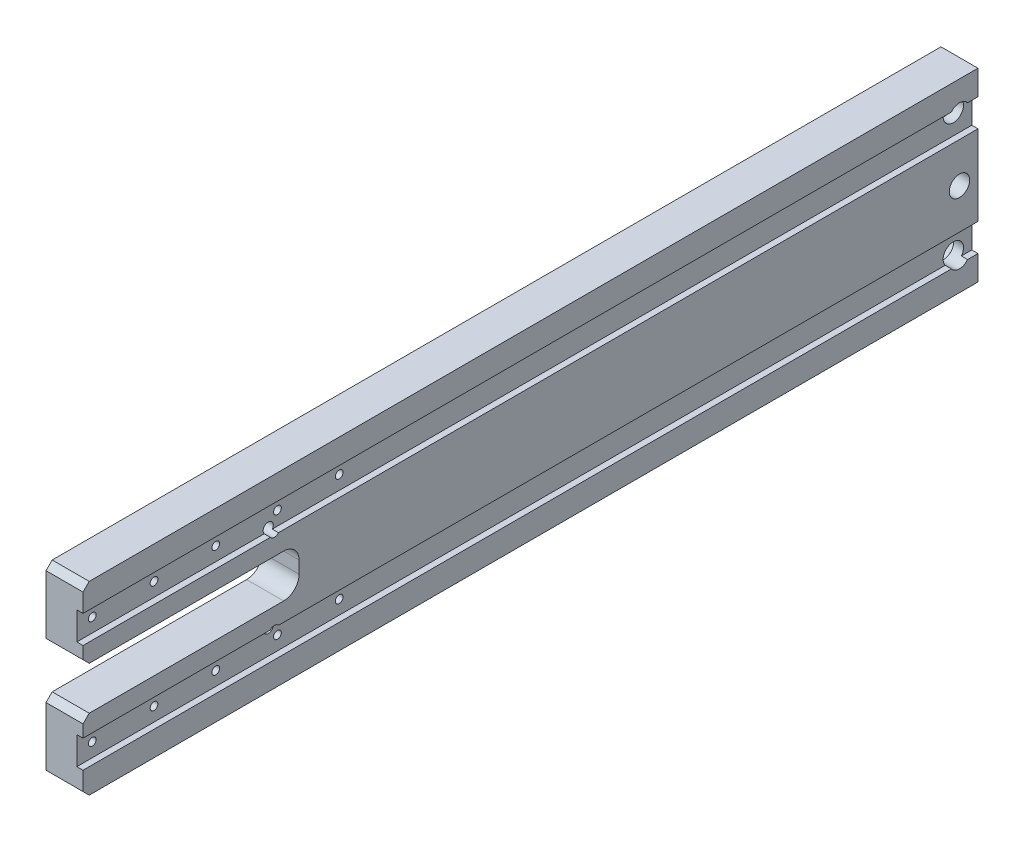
ISO-10303-21;
HEADER;
FILE_DESCRIPTION(('STEP AP214'),'2;1');
FILE_NAME('part.step','',(''),(''),'','','');
FILE_SCHEMA(('AUTOMOTIVE_DESIGN { 1 0 10303 214 1 1 1 1 }'));
ENDSEC;
DATA;
#1=APPLICATION_CONTEXT('core data for automotive mechanical design processes');
#2=APPLICATION_PROTOCOL_DEFINITION('international standard','automotive_design',2000,#1);
#3=PRODUCT_CONTEXT('',#1,'mechanical');
#4=PRODUCT('Part','Part','',(#3));
#5=PRODUCT_RELATED_PRODUCT_CATEGORY('part','',(#4));
#6=PRODUCT_DEFINITION_FORMATION('','',#4);
#7=PRODUCT_DEFINITION_CONTEXT('part definition',#1,'design');
#8=PRODUCT_DEFINITION('design','',#6,#7);
#9=PRODUCT_DEFINITION_SHAPE('','',#8);
#10=(LENGTH_UNIT() NAMED_UNIT(*) SI_UNIT(.MILLI.,.METRE.));
#11=(NAMED_UNIT(*) PLANE_ANGLE_UNIT() SI_UNIT($,.RADIAN.));
#12=(NAMED_UNIT(*) SI_UNIT($,.STERADIAN.) SOLID_ANGLE_UNIT());
#13=UNCERTAINTY_MEASURE_WITH_UNIT(LENGTH_MEASURE(1.E-05),#10,'distance_accuracy_value','');
#14=(GEOMETRIC_REPRESENTATION_CONTEXT(3) GLOBAL_UNCERTAINTY_ASSIGNED_CONTEXT((#13)) GLOBAL_UNIT_ASSIGNED_CONTEXT((#10,
#11,#12)) REPRESENTATION_CONTEXT('',''));
#15=CARTESIAN_POINT('',(0.,0.,0.));
#16=DIRECTION('',(0.,0.,1.));
#17=DIRECTION('',(1.,0.,0.));
#18=AXIS2_PLACEMENT_3D('',#15,#16,#17);
#19=CARTESIAN_POINT('',(-48.,-47.,290.));
#20=DIRECTION('',(0.,-1.,0.));
#21=DIRECTION('',(0.,0.,-1.));
#22=AXIS2_PLACEMENT_3D('',#19,#20,#21);
#23=PLANE('',#22);
#24=DIRECTION('',(0.,0.,-1.));
#25=VECTOR('',#24,1.);
#26=CARTESIAN_POINT('',(-48.,-47.,290.));
#27=LINE('',#26,#25);
#28=CARTESIAN_POINT('',(-48.,-47.,290.));
#29=VERTEX_POINT('',#28);
#30=CARTESIAN_POINT('',(-48.,-47.,229.31244047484));
#31=VERTEX_POINT('',#30);
#32=EDGE_CURVE('E236',#29,#31,#27,.T.);
#33=ORIENTED_EDGE('',*,*,#32,.T.);
#34=DIRECTION('',(-1.,0.,0.));
#35=VECTOR('',#34,1.);
#36=CARTESIAN_POINT('',(-60.,-47.,229.31244047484));
#37=LINE('',#36,#35);
#38=CARTESIAN_POINT('',(-50.,-47.,229.31244047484));
#39=VERTEX_POINT('',#38);
#40=EDGE_CURVE('E216',#31,#39,#37,.T.);
#41=ORIENTED_EDGE('',*,*,#40,.T.);
#42=DIRECTION('',(0.,0.,-1.));
#43=VECTOR('',#42,1.);
#44=CARTESIAN_POINT('',(-50.,-47.,290.));
#45=LINE('',#44,#43);
#46=CARTESIAN_POINT('',(-50.,-47.,290.));
#47=VERTEX_POINT('',#46);
#48=EDGE_CURVE('E237',#47,#39,#45,.T.);
#49=ORIENTED_EDGE('',*,*,#48,.F.);
#50=DIRECTION('',(-1.,0.,0.));
#51=VECTOR('',#50,1.);
#52=CARTESIAN_POINT('',(-48.,-47.,290.));
#53=LINE('',#52,#51);
#54=EDGE_CURVE('E362',#29,#47,#53,.T.);
#55=ORIENTED_EDGE('',*,*,#54,.F.);
#56=EDGE_LOOP('',(#33,#41,#49,#55));
#57=FACE_BOUND('',#56,.T.);
#58=ADVANCED_FACE('F16',(#57),#23,.F.);
#59=CARTESIAN_POINT('',(-48.,-73.,290.));
#60=DIRECTION('',(0.,1.,0.));
#61=DIRECTION('',(0.,0.,1.));
#62=AXIS2_PLACEMENT_3D('',#59,#60,#61);
#63=PLANE('',#62);
#64=DIRECTION('',(0.,0.,-1.));
#65=VECTOR('',#64,1.);
#66=CARTESIAN_POINT('',(-48.,-73.,290.));
#67=LINE('',#66,#65);
#68=CARTESIAN_POINT('',(-48.,-73.,226.687559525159));
#69=VERTEX_POINT('',#68);
#70=CARTESIAN_POINT('',(-48.,-73.,0.));
#71=VERTEX_POINT('',#70);
#72=EDGE_CURVE('E239',#69,#71,#67,.T.);
#73=ORIENTED_EDGE('',*,*,#72,.F.);
#74=DIRECTION('',(-1.,0.,0.));
#75=VECTOR('',#74,1.);
#76=CARTESIAN_POINT('',(-60.,-73.,226.687559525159));
#77=LINE('',#76,#75);
#78=CARTESIAN_POINT('',(-50.,-73.,226.687559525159));
#79=VERTEX_POINT('',#78);
#80=EDGE_CURVE('E529',#69,#79,#77,.T.);
#81=ORIENTED_EDGE('',*,*,#80,.T.);
#82=DIRECTION('',(0.,0.,-1.));
#83=VECTOR('',#82,1.);
#84=CARTESIAN_POINT('',(-50.,-73.,290.));
#85=LINE('',#84,#83);
#86=CARTESIAN_POINT('',(-50.,-73.,0.));
#87=VERTEX_POINT('',#86);
#88=EDGE_CURVE('E247',#79,#87,#85,.T.);
#89=ORIENTED_EDGE('',*,*,#88,.T.);
#90=DIRECTION('',(1.,0.,0.));
#91=VECTOR('',#90,1.);
#92=CARTESIAN_POINT('',(-48.,-73.,0.));
#93=LINE('',#92,#91);
#94=EDGE_CURVE('E391',#87,#71,#93,.T.);
#95=ORIENTED_EDGE('',*,*,#94,.T.);
#96=EDGE_LOOP('',(#73,#81,#89,#95));
#97=FACE_BOUND('',#96,.T.);
#98=ADVANCED_FACE('F528',(#97),#63,.F.);
#99=CARTESIAN_POINT('',(-48.,-82.,290.));
#100=DIRECTION('',(0.,-1.,0.));
#101=DIRECTION('',(0.,0.,-1.));
#102=AXIS2_PLACEMENT_3D('',#99,#100,#101);
#103=PLANE('',#102);
#104=DIRECTION('',(0.,0.,-1.));
#105=VECTOR('',#104,1.);
#106=CARTESIAN_POINT('',(-48.,-82.,290.));
#107=LINE('',#106,#105);
#108=CARTESIAN_POINT('',(-48.,-82.,290.));
#109=VERTEX_POINT('',#108);
#110=CARTESIAN_POINT('',(-48.,-82.,8.62488094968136));
#111=VERTEX_POINT('',#110);
#112=EDGE_CURVE('E256',#109,#111,#107,.T.);
#113=ORIENTED_EDGE('',*,*,#112,.T.);
#114=DIRECTION('',(-1.,0.,0.));
#115=VECTOR('',#114,1.);
#116=CARTESIAN_POINT('',(-60.,-82.,8.62488094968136));
#117=LINE('',#116,#115);
#118=CARTESIAN_POINT('',(-50.,-82.,8.62488094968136));
#119=VERTEX_POINT('',#118);
#120=EDGE_CURVE('E276',#111,#119,#117,.T.);
#121=ORIENTED_EDGE('',*,*,#120,.T.);
#122=DIRECTION('',(0.,0.,-1.));
#123=VECTOR('',#122,1.);
#124=CARTESIAN_POINT('',(-50.,-82.,290.));
#125=LINE('',#124,#123);
#126=CARTESIAN_POINT('',(-50.,-82.,290.));
#127=VERTEX_POINT('',#126);
#128=EDGE_CURVE('E252',#127,#119,#125,.T.);
#129=ORIENTED_EDGE('',*,*,#128,.F.);
#130=DIRECTION('',(-1.,0.,0.));
#131=VECTOR('',#130,1.);
#132=CARTESIAN_POINT('',(-48.,-82.,290.));
#133=LINE('',#132,#131);
#134=EDGE_CURVE('E354',#109,#127,#133,.T.);
#135=ORIENTED_EDGE('',*,*,#134,.F.);
#136=EDGE_LOOP('',(#113,#121,#129,#135));
#137=FACE_BOUND('',#136,.T.);
#138=ADVANCED_FACE('F506',(#137),#103,.F.);
#139=CARTESIAN_POINT('',(-48.,-38.,290.));
#140=DIRECTION('',(0.,1.,0.));
#141=DIRECTION('',(0.,0.,1.));
#142=AXIS2_PLACEMENT_3D('',#139,#140,#141);
#143=PLANE('',#142);
#144=DIRECTION('',(0.,0.,-1.));
#145=VECTOR('',#144,1.);
#146=CARTESIAN_POINT('',(-48.,-38.,290.));
#147=LINE('',#146,#145);
#148=CARTESIAN_POINT('',(-48.,-38.,3.37511905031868));
#149=VERTEX_POINT('',#148);
#150=CARTESIAN_POINT('',(-48.,-38.,0.));
#151=VERTEX_POINT('',#150);
#152=EDGE_CURVE('E368',#149,#151,#147,.T.);
#153=ORIENTED_EDGE('',*,*,#152,.F.);
#154=DIRECTION('',(-1.,0.,0.));
#155=VECTOR('',#154,1.);
#156=CARTESIAN_POINT('',(-60.,-38.,3.37511905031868));
#157=LINE('',#156,#155);
#158=CARTESIAN_POINT('',(-50.,-38.,3.37511905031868));
#159=VERTEX_POINT('',#158);
#160=EDGE_CURVE('E270',#149,#159,#157,.T.);
#161=ORIENTED_EDGE('',*,*,#160,.T.);
#162=DIRECTION('',(0.,0.,-1.));
#163=VECTOR('',#162,1.);
#164=CARTESIAN_POINT('',(-50.,-38.,290.));
#165=LINE('',#164,#163);
#166=CARTESIAN_POINT('',(-50.,-38.,0.));
#167=VERTEX_POINT('',#166);
#168=EDGE_CURVE('E404',#159,#167,#165,.T.);
#169=ORIENTED_EDGE('',*,*,#168,.T.);
#170=DIRECTION('',(1.,0.,0.));
#171=VECTOR('',#170,1.);
#172=CARTESIAN_POINT('',(-48.,-38.,0.));
#173=LINE('',#172,#171);
#174=EDGE_CURVE('E349',#167,#151,#173,.T.);
#175=ORIENTED_EDGE('',*,*,#174,.T.);
#176=EDGE_LOOP('',(#153,#161,#169,#175));
#177=FACE_BOUND('',#176,.T.);
#178=ADVANCED_FACE('F413',(#177),#143,.F.);
#179=CARTESIAN_POINT('',(0.,0.,290.));
#180=DIRECTION('',(0.,0.,-1.));
#181=DIRECTION('',(-1.,0.,0.));
#182=AXIS2_PLACEMENT_3D('',#179,#180,#181);
#183=PLANE('',#182);
#184=DIRECTION('',(0.,1.,0.));
#185=VECTOR('',#184,1.);
#186=CARTESIAN_POINT('',(-48.,-47.,290.));
#187=LINE('',#186,#185);
#188=CARTESIAN_POINT('',(-48.,-73.,290.));
#189=VERTEX_POINT('',#188);
#190=CARTESIAN_POINT('',(-48.,-69.,290.));
#191=VERTEX_POINT('',#190);
#192=EDGE_CURVE('E337',#189,#191,#187,.T.);
#193=ORIENTED_EDGE('',*,*,#192,.T.);
#194=DIRECTION('',(-1.,0.,0.));
#195=VECTOR('',#194,1.);
#196=CARTESIAN_POINT('',(0.,-69.,290.));
#197=LINE('',#196,#195);
#198=CARTESIAN_POINT('',(-60.,-69.,290.));
#199=VERTEX_POINT('',#198);
#200=EDGE_CURVE('E307',#191,#199,#197,.T.);
#201=ORIENTED_EDGE('',*,*,#200,.T.);
#202=DIRECTION('',(0.,-1.,0.));
#203=VECTOR('',#202,1.);
#204=CARTESIAN_POINT('',(-60.,-30.,290.));
#205=LINE('',#204,#203);
#206=CARTESIAN_POINT('',(-60.,-88.,290.));
#207=VERTEX_POINT('',#206);
#208=EDGE_CURVE('E336',#199,#207,#205,.T.);
#209=ORIENTED_EDGE('',*,*,#208,.T.);
#210=DIRECTION('',(1.,0.,0.));
#211=VECTOR('',#210,1.);
#212=CARTESIAN_POINT('',(1.01770443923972E-13,-88.,290.));
#213=LINE('',#212,#211);
#214=CARTESIAN_POINT('',(-48.,-88.,290.));
#215=VERTEX_POINT('',#214);
#216=EDGE_CURVE('E305',#207,#215,#213,.T.);
#217=ORIENTED_EDGE('',*,*,#216,.T.);
#218=DIRECTION('',(0.,1.,0.));
#219=VECTOR('',#218,1.);
#220=CARTESIAN_POINT('',(-48.,-82.,290.));
#221=LINE('',#220,#219);
#222=EDGE_CURVE('E347',#215,#109,#221,.T.);
#223=ORIENTED_EDGE('',*,*,#222,.T.);
#224=ORIENTED_EDGE('',*,*,#134,.T.);
#225=DIRECTION('',(0.,1.,0.));
#226=VECTOR('',#225,1.);
#227=CARTESIAN_POINT('',(-50.,-73.,290.));
#228=LINE('',#227,#226);
#229=CARTESIAN_POINT('',(-50.,-73.,290.));
#230=VERTEX_POINT('',#229);
#231=EDGE_CURVE('E356',#127,#230,#228,.T.);
#232=ORIENTED_EDGE('',*,*,#231,.T.);
#233=DIRECTION('',(1.,0.,0.));
#234=VECTOR('',#233,1.);
#235=CARTESIAN_POINT('',(-48.,-73.,290.));
#236=LINE('',#235,#234);
#237=EDGE_CURVE('E358',#230,#189,#236,.T.);
#238=ORIENTED_EDGE('',*,*,#237,.T.);
#239=EDGE_LOOP('',(#193,#201,#209,#217,#223,#224,#232,#238));
#240=FACE_BOUND('',#239,.T.);
#241=ADVANCED_FACE('F335',(#240),#183,.F.);
#242=CARTESIAN_POINT('',(-48.,-30.,290.));
#243=DIRECTION('',(-1.,0.,0.));
#244=DIRECTION('',(0.,-1.,0.));
#245=AXIS2_PLACEMENT_3D('',#242,#243,#244);
#246=PLANE('',#245);
#247=DIRECTION('',(0.,0.,-1.));
#248=VECTOR('',#247,1.);
#249=CARTESIAN_POINT('',(-48.,-30.,290.));
#250=LINE('',#249,#248);
#251=CARTESIAN_POINT('',(-48.,-30.,288.));
#252=VERTEX_POINT('',#251);
#253=CARTESIAN_POINT('',(-48.,-30.,0.));
#254=VERTEX_POINT('',#253);
#255=EDGE_CURVE('E265',#252,#254,#250,.T.);
#256=ORIENTED_EDGE('',*,*,#255,.F.);
#257=DIRECTION('',(0.,0.707106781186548,-0.707106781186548));
#258=VECTOR('',#257,1.);
#259=CARTESIAN_POINT('',(-48.,-32.,290.));
#260=LINE('',#259,#258);
#261=CARTESIAN_POINT('',(-48.,-32.,290.));
#262=VERTEX_POINT('',#261);
#263=EDGE_CURVE('E296',#252,#262,#260,.F.);
#264=ORIENTED_EDGE('',*,*,#263,.T.);
#265=DIRECTION('',(0.,1.,0.));
#266=VECTOR('',#265,1.);
#267=CARTESIAN_POINT('',(-48.,-30.,290.));
#268=LINE('',#267,#266);
#269=CARTESIAN_POINT('',(-48.,-38.,290.));
#270=VERTEX_POINT('',#269);
#271=EDGE_CURVE('E344',#270,#262,#268,.T.);
#272=ORIENTED_EDGE('',*,*,#271,.F.);
#273=CARTESIAN_POINT('',(-48.,-38.,8.62488094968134));
#274=VERTEX_POINT('',#273);
#275=EDGE_CURVE('E402',#270,#274,#147,.T.);
#276=ORIENTED_EDGE('',*,*,#275,.T.);
#277=CARTESIAN_POINT('',(-48.,-40.,6.));
#278=DIRECTION('',(-1.,0.,0.));
#279=DIRECTION('',(0.,0.,1.));
#280=AXIS2_PLACEMENT_3D('',#277,#278,#279);
#281=CIRCLE('',#280,3.3);
#282=EDGE_CURVE('E429',#274,#149,#281,.T.);
#283=ORIENTED_EDGE('',*,*,#282,.T.);
#284=ORIENTED_EDGE('',*,*,#152,.T.);
#285=DIRECTION('',(0.,1.,0.));
#286=VECTOR('',#285,1.);
#287=CARTESIAN_POINT('',(-48.,-30.,0.));
#288=LINE('',#287,#286);
#289=EDGE_CURVE('E369',#151,#254,#288,.T.);
#290=ORIENTED_EDGE('',*,*,#289,.T.);
#291=EDGE_LOOP('',(#256,#264,#272,#276,#283,#284,#290));
#292=FACE_BOUND('',#291,.T.);
#293=ADVANCED_FACE('F426',(#292),#246,.F.);
#294=CARTESIAN_POINT('',(-48.,-30.,290.));
#295=DIRECTION('',(0.,-1.,0.));
#296=DIRECTION('',(1.,0.,0.));
#297=AXIS2_PLACEMENT_3D('',#294,#295,#296);
#298=PLANE('',#297);
#299=DIRECTION('',(0.,0.,-1.));
#300=VECTOR('',#299,1.);
#301=CARTESIAN_POINT('',(-60.,-30.,290.));
#302=LINE('',#301,#300);
#303=CARTESIAN_POINT('',(-60.,-30.,288.));
#304=VERTEX_POINT('',#303);
#305=CARTESIAN_POINT('',(-60.,-30.,0.));
#306=VERTEX_POINT('',#305);
#307=EDGE_CURVE('E263',#304,#306,#302,.T.);
#308=ORIENTED_EDGE('',*,*,#307,.F.);
#309=DIRECTION('',(1.,0.,0.));
#310=VECTOR('',#309,1.);
#311=CARTESIAN_POINT('',(-48.,-30.,288.));
#312=LINE('',#311,#310);
#313=EDGE_CURVE('E294',#304,#252,#312,.T.);
#314=ORIENTED_EDGE('',*,*,#313,.T.);
#315=ORIENTED_EDGE('',*,*,#255,.T.);
#316=DIRECTION('',(-1.,0.,0.));
#317=VECTOR('',#316,1.);
#318=CARTESIAN_POINT('',(-48.,-30.,0.));
#319=LINE('',#318,#317);
#320=EDGE_CURVE('E372',#254,#306,#319,.T.);
#321=ORIENTED_EDGE('',*,*,#320,.T.);
#322=EDGE_LOOP('',(#308,#314,#315,#321));
#323=FACE_BOUND('',#322,.T.);
#324=ADVANCED_FACE('F494',(#323),#298,.F.);
#325=CARTESIAN_POINT('',(-60.,-30.,290.));
#326=DIRECTION('',(1.,0.,0.));
#327=DIRECTION('',(0.,0.,-1.));
#328=AXIS2_PLACEMENT_3D('',#325,#326,#327);
#329=PLANE('',#328);
#330=CARTESIAN_POINT('',(-60.,-42.499999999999,285.));
#331=DIRECTION('',(1.,0.,0.));
#332=DIRECTION('',(0.,0.,-1.));
#333=AXIS2_PLACEMENT_3D('',#330,#331,#332);
#334=CIRCLE('',#333,1.25);
#335=CARTESIAN_POINT('',(-60.,-42.499999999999,283.75));
#336=VERTEX_POINT('',#335);
#337=EDGE_CURVE('E730',#336,#336,#334,.T.);
#338=ORIENTED_EDGE('',*,*,#337,.T.);
#339=EDGE_LOOP('',(#338));
#340=FACE_BOUND('',#339,.T.);
#341=CARTESIAN_POINT('',(-60.,-42.499999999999,265.));
#342=DIRECTION('',(1.,0.,0.));
#343=DIRECTION('',(0.,0.,-1.));
#344=AXIS2_PLACEMENT_3D('',#341,#342,#343);
#345=CIRCLE('',#344,1.25);
#346=CARTESIAN_POINT('',(-60.,-42.499999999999,263.75));
#347=VERTEX_POINT('',#346);
#348=EDGE_CURVE('E740',#347,#347,#345,.T.);
#349=ORIENTED_EDGE('',*,*,#348,.T.);
#350=EDGE_LOOP('',(#349));
#351=FACE_BOUND('',#350,.T.);
#352=CARTESIAN_POINT('',(-60.,-42.499999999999,245.));
#353=DIRECTION('',(1.,0.,0.));
#354=DIRECTION('',(0.,0.,-1.));
#355=AXIS2_PLACEMENT_3D('',#352,#353,#354);
#356=CIRCLE('',#355,1.25);
#357=CARTESIAN_POINT('',(-60.,-42.499999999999,243.75));
#358=VERTEX_POINT('',#357);
#359=EDGE_CURVE('E746',#358,#358,#356,.T.);
#360=ORIENTED_EDGE('',*,*,#359,.T.);
#361=EDGE_LOOP('',(#360));
#362=FACE_BOUND('',#361,.T.);
#363=CARTESIAN_POINT('',(-60.,-42.499999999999,225.));
#364=DIRECTION('',(1.,0.,0.));
#365=DIRECTION('',(0.,0.,-1.));
#366=AXIS2_PLACEMENT_3D('',#363,#364,#365);
#367=CIRCLE('',#366,1.25);
#368=CARTESIAN_POINT('',(-60.,-42.499999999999,223.75));
#369=VERTEX_POINT('',#368);
#370=EDGE_CURVE('E752',#369,#369,#367,.T.);
#371=ORIENTED_EDGE('',*,*,#370,.T.);
#372=EDGE_LOOP('',(#371));
#373=FACE_BOUND('',#372,.T.);
#374=CARTESIAN_POINT('',(-60.,-42.499999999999,205.));
#375=DIRECTION('',(1.,0.,0.));
#376=DIRECTION('',(0.,0.,-1.));
#377=AXIS2_PLACEMENT_3D('',#374,#375,#376);
#378=CIRCLE('',#377,1.25);
#379=CARTESIAN_POINT('',(-60.,-42.499999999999,203.75));
#380=VERTEX_POINT('',#379);
#381=EDGE_CURVE('E758',#380,#380,#378,.T.);
#382=ORIENTED_EDGE('',*,*,#381,.T.);
#383=EDGE_LOOP('',(#382));
#384=FACE_BOUND('',#383,.T.);
#385=CARTESIAN_POINT('',(-60.,-77.499999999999,205.));
#386=DIRECTION('',(1.,0.,0.));
#387=DIRECTION('',(0.,0.,-1.));
#388=AXIS2_PLACEMENT_3D('',#385,#386,#387);
#389=CIRCLE('',#388,1.25);
#390=CARTESIAN_POINT('',(-60.,-77.499999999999,203.75));
#391=VERTEX_POINT('',#390);
#392=EDGE_CURVE('E764',#391,#391,#389,.T.);
#393=ORIENTED_EDGE('',*,*,#392,.T.);
#394=EDGE_LOOP('',(#393));
#395=FACE_BOUND('',#394,.T.);
#396=CARTESIAN_POINT('',(-60.,-77.499999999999,225.));
#397=DIRECTION('',(1.,0.,0.));
#398=DIRECTION('',(0.,0.,-1.));
#399=AXIS2_PLACEMENT_3D('',#396,#397,#398);
#400=CIRCLE('',#399,1.25);
#401=CARTESIAN_POINT('',(-60.,-77.499999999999,223.75));
#402=VERTEX_POINT('',#401);
#403=EDGE_CURVE('E770',#402,#402,#400,.T.);
#404=ORIENTED_EDGE('',*,*,#403,.T.);
#405=EDGE_LOOP('',(#404));
#406=FACE_BOUND('',#405,.T.);
#407=CARTESIAN_POINT('',(-60.,-77.499999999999,245.));
#408=DIRECTION('',(1.,0.,0.));
#409=DIRECTION('',(0.,0.,-1.));
#410=AXIS2_PLACEMENT_3D('',#407,#408,#409);
#411=CIRCLE('',#410,1.25);
#412=CARTESIAN_POINT('',(-60.,-77.499999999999,243.75));
#413=VERTEX_POINT('',#412);
#414=EDGE_CURVE('E776',#413,#413,#411,.T.);
#415=ORIENTED_EDGE('',*,*,#414,.T.);
#416=EDGE_LOOP('',(#415));
#417=FACE_BOUND('',#416,.T.);
#418=CARTESIAN_POINT('',(-60.,-77.499999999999,265.));
#419=DIRECTION('',(1.,0.,0.));
#420=DIRECTION('',(0.,0.,-1.));
#421=AXIS2_PLACEMENT_3D('',#418,#419,#420);
#422=CIRCLE('',#421,1.25);
#423=CARTESIAN_POINT('',(-60.,-77.499999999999,263.75));
#424=VERTEX_POINT('',#423);
#425=EDGE_CURVE('E782',#424,#424,#422,.T.);
#426=ORIENTED_EDGE('',*,*,#425,.T.);
#427=EDGE_LOOP('',(#426));
#428=FACE_BOUND('',#427,.T.);
#429=CARTESIAN_POINT('',(-60.,-77.499999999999,285.));
#430=DIRECTION('',(1.,0.,0.));
#431=DIRECTION('',(0.,0.,-1.));
#432=AXIS2_PLACEMENT_3D('',#429,#430,#431);
#433=CIRCLE('',#432,1.25);
#434=CARTESIAN_POINT('',(-60.,-77.499999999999,283.75));
#435=VERTEX_POINT('',#434);
#436=EDGE_CURVE('E788',#435,#435,#433,.T.);
#437=ORIENTED_EDGE('',*,*,#436,.T.);
#438=EDGE_LOOP('',(#437));
#439=FACE_BOUND('',#438,.T.);
#440=CARTESIAN_POINT('',(-60.,-45.999999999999,228.));
#441=DIRECTION('',(-1.,0.,0.));
#442=DIRECTION('',(0.,0.,1.));
#443=AXIS2_PLACEMENT_3D('',#440,#441,#442);
#444=CIRCLE('',#443,1.65);
#445=CARTESIAN_POINT('',(-60.,-45.999999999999,229.65));
#446=VERTEX_POINT('',#445);
#447=EDGE_CURVE('E221',#446,#446,#444,.T.);
#448=ORIENTED_EDGE('',*,*,#447,.F.);
#449=EDGE_LOOP('',(#448));
#450=FACE_BOUND('',#449,.T.);
#451=CARTESIAN_POINT('',(-60.,-73.999999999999,228.));
#452=DIRECTION('',(-1.,0.,0.));
#453=DIRECTION('',(0.,0.,1.));
#454=AXIS2_PLACEMENT_3D('',#451,#452,#453);
#455=CIRCLE('',#454,1.65);
#456=CARTESIAN_POINT('',(-60.,-73.999999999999,229.65));
#457=VERTEX_POINT('',#456);
#458=EDGE_CURVE('E524',#457,#457,#455,.T.);
#459=ORIENTED_EDGE('',*,*,#458,.F.);
#460=EDGE_LOOP('',(#459));
#461=FACE_BOUND('',#460,.T.);
#462=CARTESIAN_POINT('',(-60.,-80.,6.));
#463=DIRECTION('',(-1.,0.,0.));
#464=DIRECTION('',(0.,0.,1.));
#465=AXIS2_PLACEMENT_3D('',#462,#463,#464);
#466=CIRCLE('',#465,5.525);
#467=CARTESIAN_POINT('',(-60.,-80.,11.525));
#468=VERTEX_POINT('',#467);
#469=EDGE_CURVE('E799',#468,#468,#466,.T.);
#470=ORIENTED_EDGE('',*,*,#469,.F.);
#471=EDGE_LOOP('',(#470));
#472=FACE_BOUND('',#471,.T.);
#473=CARTESIAN_POINT('',(-60.,-60.,6.));
#474=DIRECTION('',(-1.,0.,0.));
#475=DIRECTION('',(0.,0.,1.));
#476=AXIS2_PLACEMENT_3D('',#473,#474,#475);
#477=CIRCLE('',#476,5.525);
#478=CARTESIAN_POINT('',(-60.,-60.,11.525));
#479=VERTEX_POINT('',#478);
#480=EDGE_CURVE('E816',#479,#479,#477,.T.);
#481=ORIENTED_EDGE('',*,*,#480,.F.);
#482=EDGE_LOOP('',(#481));
#483=FACE_BOUND('',#482,.T.);
#484=CARTESIAN_POINT('',(-60.,-40.,6.));
#485=DIRECTION('',(-1.,0.,0.));
#486=DIRECTION('',(0.,0.,1.));
#487=AXIS2_PLACEMENT_3D('',#484,#485,#486);
#488=CIRCLE('',#487,5.525);
#489=CARTESIAN_POINT('',(-60.,-40.,11.525));
#490=VERTEX_POINT('',#489);
#491=EDGE_CURVE('E833',#490,#490,#488,.T.);
#492=ORIENTED_EDGE('',*,*,#491,.F.);
#493=EDGE_LOOP('',(#492));
#494=FACE_BOUND('',#493,.T.);
#495=CARTESIAN_POINT('',(-60.,-32.,290.));
#496=VERTEX_POINT('',#495);
#497=CARTESIAN_POINT('',(-60.,-51.,290.));
#498=VERTEX_POINT('',#497);
#499=EDGE_CURVE('E343',#496,#498,#205,.T.);
#500=ORIENTED_EDGE('',*,*,#499,.F.);
#501=DIRECTION('',(0.,-0.707106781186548,0.707106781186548));
#502=VECTOR('',#501,1.);
#503=CARTESIAN_POINT('',(-60.,-32.,290.));
#504=LINE('',#503,#502);
#505=EDGE_CURVE('E292',#496,#304,#504,.F.);
#506=ORIENTED_EDGE('',*,*,#505,.T.);
#507=ORIENTED_EDGE('',*,*,#307,.T.);
#508=DIRECTION('',(0.,-1.,0.));
#509=VECTOR('',#508,1.);
#510=CARTESIAN_POINT('',(-60.,-30.,0.));
#511=LINE('',#510,#509);
#512=CARTESIAN_POINT('',(-60.,-90.,0.));
#513=VERTEX_POINT('',#512);
#514=EDGE_CURVE('E376',#306,#513,#511,.T.);
#515=ORIENTED_EDGE('',*,*,#514,.T.);
#516=DIRECTION('',(0.,0.,-1.));
#517=VECTOR('',#516,1.);
#518=CARTESIAN_POINT('',(-60.,-90.,290.));
#519=LINE('',#518,#517);
#520=CARTESIAN_POINT('',(-60.,-90.,288.));
#521=VERTEX_POINT('',#520);
#522=EDGE_CURVE('E261',#521,#513,#519,.T.);
#523=ORIENTED_EDGE('',*,*,#522,.F.);
#524=DIRECTION('',(0.,-0.707106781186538,-0.707106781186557));
#525=VECTOR('',#524,1.);
#526=CARTESIAN_POINT('',(-60.,-88.,290.));
#527=LINE('',#526,#525);
#528=EDGE_CURVE('E286',#521,#207,#527,.F.);
#529=ORIENTED_EDGE('',*,*,#528,.T.);
#530=ORIENTED_EDGE('',*,*,#208,.F.);
#531=DIRECTION('',(0.,-0.707106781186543,0.707106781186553));
#532=VECTOR('',#531,1.);
#533=CARTESIAN_POINT('',(-60.,-69.,290.));
#534=LINE('',#533,#532);
#535=CARTESIAN_POINT('',(-60.,-67.,288.));
#536=VERTEX_POINT('',#535);
#537=EDGE_CURVE('E288',#199,#536,#534,.F.);
#538=ORIENTED_EDGE('',*,*,#537,.T.);
#539=DIRECTION('',(0.,0.,1.));
#540=VECTOR('',#539,1.);
#541=CARTESIAN_POINT('',(-60.,-67.,290.));
#542=LINE('',#541,#540);
#543=CARTESIAN_POINT('',(-60.,-67.,225.));
#544=VERTEX_POINT('',#543);
#545=EDGE_CURVE('E320',#544,#536,#542,.T.);
#546=ORIENTED_EDGE('',*,*,#545,.F.);
#547=CARTESIAN_POINT('',(-60.,-62.,225.));
#548=DIRECTION('',(-1.,0.,0.));
#549=DIRECTION('',(0.,0.,-1.));
#550=AXIS2_PLACEMENT_3D('',#547,#548,#549);
#551=CIRCLE('',#550,5.);
#552=CARTESIAN_POINT('',(-60.,-62.,220.));
#553=VERTEX_POINT('',#552);
#554=EDGE_CURVE('E458',#553,#544,#551,.T.);
#555=ORIENTED_EDGE('',*,*,#554,.F.);
#556=DIRECTION('',(0.,-1.,0.));
#557=VECTOR('',#556,1.);
#558=CARTESIAN_POINT('',(-60.,-58.,220.));
#559=LINE('',#558,#557);
#560=CARTESIAN_POINT('',(-60.,-58.,220.));
#561=VERTEX_POINT('',#560);
#562=EDGE_CURVE('E455',#561,#553,#559,.T.);
#563=ORIENTED_EDGE('',*,*,#562,.F.);
#564=CARTESIAN_POINT('',(-60.,-58.,225.));
#565=DIRECTION('',(-1.,0.,0.));
#566=DIRECTION('',(0.,0.,-1.));
#567=AXIS2_PLACEMENT_3D('',#564,#565,#566);
#568=CIRCLE('',#567,5.);
#569=CARTESIAN_POINT('',(-60.,-53.,225.));
#570=VERTEX_POINT('',#569);
#571=EDGE_CURVE('E452',#570,#561,#568,.T.);
#572=ORIENTED_EDGE('',*,*,#571,.F.);
#573=DIRECTION('',(0.,0.,-1.));
#574=VECTOR('',#573,1.);
#575=CARTESIAN_POINT('',(-60.,-53.,290.));
#576=LINE('',#575,#574);
#577=CARTESIAN_POINT('',(-60.,-53.,288.));
#578=VERTEX_POINT('',#577);
#579=EDGE_CURVE('E436',#578,#570,#576,.T.);
#580=ORIENTED_EDGE('',*,*,#579,.F.);
#581=DIRECTION('',(0.,-0.707106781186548,-0.707106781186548));
#582=VECTOR('',#581,1.);
#583=CARTESIAN_POINT('',(-60.,-53.,288.));
#584=LINE('',#583,#582);
#585=EDGE_CURVE('E290',#578,#498,#584,.F.);
#586=ORIENTED_EDGE('',*,*,#585,.T.);
#587=EDGE_LOOP('',(#500,#506,#507,#515,#523,#529,#530,#538,#546,#555,#563,#572,#580,#586));
#588=FACE_BOUND('',#587,.T.);
#589=ADVANCED_FACE('F340',(#340,#351,#362,#373,#384,#395,#406,#417,#428,#439,#450,#461,#472,
#483,#494,#588),#329,.F.);
#590=CARTESIAN_POINT('',(-48.,-90.,290.));
#591=DIRECTION('',(0.,1.,0.));
#592=DIRECTION('',(-1.,0.,0.));
#593=AXIS2_PLACEMENT_3D('',#590,#591,#592);
#594=PLANE('',#593);
#595=DIRECTION('',(0.,0.,-1.));
#596=VECTOR('',#595,1.);
#597=CARTESIAN_POINT('',(-48.,-90.,290.));
#598=LINE('',#597,#596);
#599=CARTESIAN_POINT('',(-48.,-90.,288.));
#600=VERTEX_POINT('',#599);
#601=CARTESIAN_POINT('',(-48.,-90.,0.));
#602=VERTEX_POINT('',#601);
#603=EDGE_CURVE('E259',#600,#602,#598,.T.);
#604=ORIENTED_EDGE('',*,*,#603,.F.);
#605=DIRECTION('',(-1.,0.,0.));
#606=VECTOR('',#605,1.);
#607=CARTESIAN_POINT('',(-48.,-90.,288.));
#608=LINE('',#607,#606);
#609=EDGE_CURVE('E11',#600,#521,#608,.T.);
#610=ORIENTED_EDGE('',*,*,#609,.T.);
#611=ORIENTED_EDGE('',*,*,#522,.T.);
#612=DIRECTION('',(1.,0.,0.));
#613=VECTOR('',#612,1.);
#614=CARTESIAN_POINT('',(-48.,-90.,0.));
#615=LINE('',#614,#613);
#616=EDGE_CURVE('E379',#513,#602,#615,.T.);
#617=ORIENTED_EDGE('',*,*,#616,.T.);
#618=EDGE_LOOP('',(#604,#610,#611,#617));
#619=FACE_BOUND('',#618,.T.);
#620=ADVANCED_FACE('F538',(#619),#594,.F.);
#621=CARTESIAN_POINT('',(-48.,-82.,290.));
#622=DIRECTION('',(-1.,0.,0.));
#623=DIRECTION('',(0.,0.,1.));
#624=AXIS2_PLACEMENT_3D('',#621,#622,#623);
#625=PLANE('',#624);
#626=ORIENTED_EDGE('',*,*,#222,.F.);
#627=DIRECTION('',(0.,0.707106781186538,0.707106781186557));
#628=VECTOR('',#627,1.);
#629=CARTESIAN_POINT('',(-48.,-88.,290.));
#630=LINE('',#629,#628);
#631=EDGE_CURVE('E24',#215,#600,#630,.F.);
#632=ORIENTED_EDGE('',*,*,#631,.T.);
#633=ORIENTED_EDGE('',*,*,#603,.T.);
#634=DIRECTION('',(0.,1.,0.));
#635=VECTOR('',#634,1.);
#636=CARTESIAN_POINT('',(-48.,-82.,0.));
#637=LINE('',#636,#635);
#638=CARTESIAN_POINT('',(-48.,-82.,0.));
#639=VERTEX_POINT('',#638);
#640=EDGE_CURVE('E382',#602,#639,#637,.T.);
#641=ORIENTED_EDGE('',*,*,#640,.T.);
#642=CARTESIAN_POINT('',(-48.,-82.,3.37511905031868));
#643=VERTEX_POINT('',#642);
#644=EDGE_CURVE('E255',#643,#639,#107,.T.);
#645=ORIENTED_EDGE('',*,*,#644,.F.);
#646=CARTESIAN_POINT('',(-48.,-80.,6.));
#647=DIRECTION('',(-1.,0.,0.));
#648=DIRECTION('',(0.,0.,1.));
#649=AXIS2_PLACEMENT_3D('',#646,#647,#648);
#650=CIRCLE('',#649,3.3);
#651=EDGE_CURVE('E503',#643,#111,#650,.T.);
#652=ORIENTED_EDGE('',*,*,#651,.T.);
#653=ORIENTED_EDGE('',*,*,#112,.F.);
#654=EDGE_LOOP('',(#626,#632,#633,#641,#645,#652,#653));
#655=FACE_BOUND('',#654,.T.);
#656=ADVANCED_FACE('F499',(#655),#625,.F.);
#657=CARTESIAN_POINT('',(-50.,-82.,3.37511905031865));
#658=VERTEX_POINT('',#657);
#659=CARTESIAN_POINT('',(-50.,-82.,0.));
#660=VERTEX_POINT('',#659);
#661=EDGE_CURVE('E251',#658,#660,#125,.T.);
#662=ORIENTED_EDGE('',*,*,#661,.F.);
#663=DIRECTION('',(-1.,0.,0.));
#664=VECTOR('',#663,1.);
#665=CARTESIAN_POINT('',(-60.,-82.,3.37511905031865));
#666=LINE('',#665,#664);
#667=EDGE_CURVE('E273',#658,#643,#666,.F.);
#668=ORIENTED_EDGE('',*,*,#667,.T.);
#669=ORIENTED_EDGE('',*,*,#644,.T.);
#670=DIRECTION('',(-1.,0.,0.));
#671=VECTOR('',#670,1.);
#672=CARTESIAN_POINT('',(-48.,-82.,0.));
#673=LINE('',#672,#671);
#674=EDGE_CURVE('E385',#639,#660,#673,.T.);
#675=ORIENTED_EDGE('',*,*,#674,.T.);
#676=EDGE_LOOP('',(#662,#668,#669,#675));
#677=FACE_BOUND('',#676,.T.);
#678=ADVANCED_FACE('F537',(#677),#103,.F.);
#679=CARTESIAN_POINT('',(-50.,-73.,290.));
#680=DIRECTION('',(-1.,0.,0.));
#681=DIRECTION('',(0.,0.,1.));
#682=AXIS2_PLACEMENT_3D('',#679,#680,#681);
#683=PLANE('',#682);
#684=CARTESIAN_POINT('',(-50.,-77.499999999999,205.));
#685=DIRECTION('',(1.,0.,0.));
#686=DIRECTION('',(0.,0.,-1.));
#687=AXIS2_PLACEMENT_3D('',#684,#685,#686);
#688=CIRCLE('',#687,1.25);
#689=CARTESIAN_POINT('',(-50.,-77.499999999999,203.75));
#690=VERTEX_POINT('',#689);
#691=EDGE_CURVE('E761',#690,#690,#688,.T.);
#692=ORIENTED_EDGE('',*,*,#691,.F.);
#693=EDGE_LOOP('',(#692));
#694=FACE_BOUND('',#693,.T.);
#695=CARTESIAN_POINT('',(-50.,-77.499999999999,225.));
#696=DIRECTION('',(1.,0.,0.));
#697=DIRECTION('',(0.,0.,-1.));
#698=AXIS2_PLACEMENT_3D('',#695,#696,#697);
#699=CIRCLE('',#698,1.25);
#700=CARTESIAN_POINT('',(-50.,-77.499999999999,223.75));
#701=VERTEX_POINT('',#700);
#702=EDGE_CURVE('E767',#701,#701,#699,.T.);
#703=ORIENTED_EDGE('',*,*,#702,.F.);
#704=EDGE_LOOP('',(#703));
#705=FACE_BOUND('',#704,.T.);
#706=CARTESIAN_POINT('',(-50.,-77.499999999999,245.));
#707=DIRECTION('',(1.,0.,0.));
#708=DIRECTION('',(0.,0.,-1.));
#709=AXIS2_PLACEMENT_3D('',#706,#707,#708);
#710=CIRCLE('',#709,1.25);
#711=CARTESIAN_POINT('',(-50.,-77.499999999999,243.75));
#712=VERTEX_POINT('',#711);
#713=EDGE_CURVE('E773',#712,#712,#710,.T.);
#714=ORIENTED_EDGE('',*,*,#713,.F.);
#715=EDGE_LOOP('',(#714));
#716=FACE_BOUND('',#715,.T.);
#717=CARTESIAN_POINT('',(-50.,-77.499999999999,265.));
#718=DIRECTION('',(1.,0.,0.));
#719=DIRECTION('',(0.,0.,-1.));
#720=AXIS2_PLACEMENT_3D('',#717,#718,#719);
#721=CIRCLE('',#720,1.25);
#722=CARTESIAN_POINT('',(-50.,-77.499999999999,263.75));
#723=VERTEX_POINT('',#722);
#724=EDGE_CURVE('E779',#723,#723,#721,.T.);
#725=ORIENTED_EDGE('',*,*,#724,.F.);
#726=EDGE_LOOP('',(#725));
#727=FACE_BOUND('',#726,.T.);
#728=CARTESIAN_POINT('',(-50.,-77.499999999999,285.));
#729=DIRECTION('',(1.,0.,0.));
#730=DIRECTION('',(0.,0.,-1.));
#731=AXIS2_PLACEMENT_3D('',#728,#729,#730);
#732=CIRCLE('',#731,1.25);
#733=CARTESIAN_POINT('',(-50.,-77.499999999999,283.75));
#734=VERTEX_POINT('',#733);
#735=EDGE_CURVE('E785',#734,#734,#732,.T.);
#736=ORIENTED_EDGE('',*,*,#735,.F.);
#737=EDGE_LOOP('',(#736));
#738=FACE_BOUND('',#737,.T.);
#739=ORIENTED_EDGE('',*,*,#88,.F.);
#740=CARTESIAN_POINT('',(-50.,-73.999999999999,228.));
#741=DIRECTION('',(-1.,0.,0.));
#742=DIRECTION('',(0.,0.,1.));
#743=AXIS2_PLACEMENT_3D('',#740,#741,#742);
#744=CIRCLE('',#743,1.65);
#745=CARTESIAN_POINT('',(-50.,-73.,229.312440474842));
#746=VERTEX_POINT('',#745);
#747=EDGE_CURVE('E515',#79,#746,#744,.T.);
#748=ORIENTED_EDGE('',*,*,#747,.T.);
#749=EDGE_CURVE('E248',#230,#746,#85,.T.);
#750=ORIENTED_EDGE('',*,*,#749,.F.);
#751=ORIENTED_EDGE('',*,*,#231,.F.);
#752=ORIENTED_EDGE('',*,*,#128,.T.);
#753=CARTESIAN_POINT('',(-50.,-80.,6.));
#754=DIRECTION('',(-1.,0.,0.));
#755=DIRECTION('',(0.,0.,1.));
#756=AXIS2_PLACEMENT_3D('',#753,#754,#755);
#757=CIRCLE('',#756,3.3);
#758=EDGE_CURVE('E535',#119,#658,#757,.T.);
#759=ORIENTED_EDGE('',*,*,#758,.T.);
#760=ORIENTED_EDGE('',*,*,#661,.T.);
#761=DIRECTION('',(0.,1.,0.));
#762=VECTOR('',#761,1.);
#763=CARTESIAN_POINT('',(-50.,-73.,0.));
#764=LINE('',#763,#762);
#765=EDGE_CURVE('E388',#660,#87,#764,.T.);
#766=ORIENTED_EDGE('',*,*,#765,.T.);
#767=EDGE_LOOP('',(#739,#748,#750,#751,#752,#759,#760,#766));
#768=FACE_BOUND('',#767,.T.);
#769=ADVANCED_FACE('F514',(#694,#705,#716,#727,#738,#768),#683,.F.);
#770=ORIENTED_EDGE('',*,*,#749,.T.);
#771=DIRECTION('',(-1.,0.,0.));
#772=VECTOR('',#771,1.);
#773=CARTESIAN_POINT('',(-60.,-73.,229.312440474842));
#774=LINE('',#773,#772);
#775=CARTESIAN_POINT('',(-48.,-73.,229.312440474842));
#776=VERTEX_POINT('',#775);
#777=EDGE_CURVE('E519',#746,#776,#774,.F.);
#778=ORIENTED_EDGE('',*,*,#777,.T.);
#779=EDGE_CURVE('E244',#189,#776,#67,.T.);
#780=ORIENTED_EDGE('',*,*,#779,.F.);
#781=ORIENTED_EDGE('',*,*,#237,.F.);
#782=EDGE_LOOP('',(#770,#778,#780,#781));
#783=FACE_BOUND('',#782,.T.);
#784=ADVANCED_FACE('F518',(#783),#63,.F.);
#785=CARTESIAN_POINT('',(-48.,-47.,290.));
#786=DIRECTION('',(-1.,0.,0.));
#787=DIRECTION('',(0.,0.,1.));
#788=AXIS2_PLACEMENT_3D('',#785,#786,#787);
#789=PLANE('',#788);
#790=CARTESIAN_POINT('',(-48.,-60.,6.));
#791=DIRECTION('',(-1.,0.,0.));
#792=DIRECTION('',(0.,0.,1.));
#793=AXIS2_PLACEMENT_3D('',#790,#791,#792);
#794=CIRCLE('',#793,3.3);
#795=CARTESIAN_POINT('',(-48.,-60.,9.3));
#796=VERTEX_POINT('',#795);
#797=EDGE_CURVE('E831',#796,#796,#794,.T.);
#798=ORIENTED_EDGE('',*,*,#797,.T.);
#799=EDGE_LOOP('',(#798));
#800=FACE_BOUND('',#799,.T.);
#801=CARTESIAN_POINT('',(-48.,-51.,290.));
#802=VERTEX_POINT('',#801);
#803=EDGE_CURVE('E360',#802,#29,#187,.T.);
#804=ORIENTED_EDGE('',*,*,#803,.F.);
#805=DIRECTION('',(0.,0.707106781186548,0.707106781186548));
#806=VECTOR('',#805,1.);
#807=CARTESIAN_POINT('',(-48.,-53.,288.));
#808=LINE('',#807,#806);
#809=CARTESIAN_POINT('',(-48.,-53.,288.));
#810=VERTEX_POINT('',#809);
#811=EDGE_CURVE('E303',#802,#810,#808,.F.);
#812=ORIENTED_EDGE('',*,*,#811,.T.);
#813=DIRECTION('',(0.,0.,-1.));
#814=VECTOR('',#813,1.);
#815=CARTESIAN_POINT('',(-48.,-53.,290.));
#816=LINE('',#815,#814);
#817=CARTESIAN_POINT('',(-48.,-53.,225.));
#818=VERTEX_POINT('',#817);
#819=EDGE_CURVE('E443',#810,#818,#816,.T.);
#820=ORIENTED_EDGE('',*,*,#819,.T.);
#821=CARTESIAN_POINT('',(-48.,-58.,225.));
#822=DIRECTION('',(-1.,0.,0.));
#823=DIRECTION('',(0.,0.,-1.));
#824=AXIS2_PLACEMENT_3D('',#821,#822,#823);
#825=CIRCLE('',#824,5.);
#826=CARTESIAN_POINT('',(-48.,-58.,220.));
#827=VERTEX_POINT('',#826);
#828=EDGE_CURVE('E445',#818,#827,#825,.T.);
#829=ORIENTED_EDGE('',*,*,#828,.T.);
#830=DIRECTION('',(0.,-1.,0.));
#831=VECTOR('',#830,1.);
#832=CARTESIAN_POINT('',(-48.,-58.,220.));
#833=LINE('',#832,#831);
#834=CARTESIAN_POINT('',(-48.,-62.,220.));
#835=VERTEX_POINT('',#834);
#836=EDGE_CURVE('E448',#827,#835,#833,.T.);
#837=ORIENTED_EDGE('',*,*,#836,.T.);
#838=CARTESIAN_POINT('',(-48.,-62.,225.));
#839=DIRECTION('',(-1.,0.,0.));
#840=DIRECTION('',(0.,0.,-1.));
#841=AXIS2_PLACEMENT_3D('',#838,#839,#840);
#842=CIRCLE('',#841,5.);
#843=CARTESIAN_POINT('',(-48.,-67.,225.));
#844=VERTEX_POINT('',#843);
#845=EDGE_CURVE('E327',#835,#844,#842,.T.);
#846=ORIENTED_EDGE('',*,*,#845,.T.);
#847=DIRECTION('',(0.,0.,1.));
#848=VECTOR('',#847,1.);
#849=CARTESIAN_POINT('',(-48.,-67.,290.));
#850=LINE('',#849,#848);
#851=CARTESIAN_POINT('',(-48.,-67.,288.));
#852=VERTEX_POINT('',#851);
#853=EDGE_CURVE('E317',#844,#852,#850,.T.);
#854=ORIENTED_EDGE('',*,*,#853,.T.);
#855=DIRECTION('',(0.,0.707106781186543,-0.707106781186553));
#856=VECTOR('',#855,1.);
#857=CARTESIAN_POINT('',(-48.,-69.,290.));
#858=LINE('',#857,#856);
#859=EDGE_CURVE('E301',#852,#191,#858,.F.);
#860=ORIENTED_EDGE('',*,*,#859,.T.);
#861=ORIENTED_EDGE('',*,*,#192,.F.);
#862=ORIENTED_EDGE('',*,*,#779,.T.);
#863=CARTESIAN_POINT('',(-48.,-73.999999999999,228.));
#864=DIRECTION('',(-1.,0.,0.));
#865=DIRECTION('',(0.,0.,1.));
#866=AXIS2_PLACEMENT_3D('',#863,#864,#865);
#867=CIRCLE('',#866,1.65);
#868=EDGE_CURVE('E521',#776,#69,#867,.T.);
#869=ORIENTED_EDGE('',*,*,#868,.T.);
#870=ORIENTED_EDGE('',*,*,#72,.T.);
#871=DIRECTION('',(0.,1.,0.));
#872=VECTOR('',#871,1.);
#873=CARTESIAN_POINT('',(-48.,-47.,0.));
#874=LINE('',#873,#872);
#875=CARTESIAN_POINT('',(-48.,-47.,0.));
#876=VERTEX_POINT('',#875);
#877=EDGE_CURVE('E234',#71,#876,#874,.T.);
#878=ORIENTED_EDGE('',*,*,#877,.T.);
#879=CARTESIAN_POINT('',(-48.,-47.,226.68755952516));
#880=VERTEX_POINT('',#879);
#881=EDGE_CURVE('E227',#880,#876,#27,.T.);
#882=ORIENTED_EDGE('',*,*,#881,.F.);
#883=CARTESIAN_POINT('',(-48.,-45.999999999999,228.));
#884=DIRECTION('',(-1.,0.,0.));
#885=DIRECTION('',(0.,0.,1.));
#886=AXIS2_PLACEMENT_3D('',#883,#884,#885);
#887=CIRCLE('',#886,1.65);
#888=EDGE_CURVE('E210',#880,#31,#887,.T.);
#889=ORIENTED_EDGE('',*,*,#888,.T.);
#890=ORIENTED_EDGE('',*,*,#32,.F.);
#891=EDGE_LOOP('',(#804,#812,#820,#829,#837,#846,#854,#860,#861,#862,#869,#870,#878,#882,#889,#890));
#892=FACE_BOUND('',#891,.T.);
#893=ADVANCED_FACE('F232',(#800,#892),#789,.F.);
#894=CARTESIAN_POINT('',(-50.,-47.,226.68755952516));
#895=VERTEX_POINT('',#894);
#896=CARTESIAN_POINT('',(-50.,-47.,0.));
#897=VERTEX_POINT('',#896);
#898=EDGE_CURVE('E229',#895,#897,#45,.T.);
#899=ORIENTED_EDGE('',*,*,#898,.F.);
#900=DIRECTION('',(-1.,0.,0.));
#901=VECTOR('',#900,1.);
#902=CARTESIAN_POINT('',(-60.,-47.,226.68755952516));
#903=LINE('',#902,#901);
#904=EDGE_CURVE('E213',#895,#880,#903,.F.);
#905=ORIENTED_EDGE('',*,*,#904,.T.);
#906=ORIENTED_EDGE('',*,*,#881,.T.);
#907=DIRECTION('',(-1.,0.,0.));
#908=VECTOR('',#907,1.);
#909=CARTESIAN_POINT('',(-48.,-47.,0.));
#910=LINE('',#909,#908);
#911=EDGE_CURVE('E395',#876,#897,#910,.T.);
#912=ORIENTED_EDGE('',*,*,#911,.T.);
#913=EDGE_LOOP('',(#899,#905,#906,#912));
#914=FACE_BOUND('',#913,.T.);
#915=ADVANCED_FACE('F225',(#914),#23,.F.);
#916=CARTESIAN_POINT('',(-50.,-38.,290.));
#917=DIRECTION('',(-1.,0.,0.));
#918=DIRECTION('',(0.,-1.,0.));
#919=AXIS2_PLACEMENT_3D('',#916,#917,#918);
#920=PLANE('',#919);
#921=CARTESIAN_POINT('',(-50.,-42.499999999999,285.));
#922=DIRECTION('',(1.,0.,0.));
#923=DIRECTION('',(0.,0.,-1.));
#924=AXIS2_PLACEMENT_3D('',#921,#922,#923);
#925=CIRCLE('',#924,1.25);
#926=CARTESIAN_POINT('',(-50.,-42.499999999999,283.75));
#927=VERTEX_POINT('',#926);
#928=EDGE_CURVE('E733',#927,#927,#925,.T.);
#929=ORIENTED_EDGE('',*,*,#928,.F.);
#930=EDGE_LOOP('',(#929));
#931=FACE_BOUND('',#930,.T.);
#932=CARTESIAN_POINT('',(-50.,-42.499999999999,265.));
#933=DIRECTION('',(1.,0.,0.));
#934=DIRECTION('',(0.,0.,-1.));
#935=AXIS2_PLACEMENT_3D('',#932,#933,#934);
#936=CIRCLE('',#935,1.25);
#937=CARTESIAN_POINT('',(-50.,-42.499999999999,263.75));
#938=VERTEX_POINT('',#937);
#939=EDGE_CURVE('E735',#938,#938,#936,.T.);
#940=ORIENTED_EDGE('',*,*,#939,.F.);
#941=EDGE_LOOP('',(#940));
#942=FACE_BOUND('',#941,.T.);
#943=CARTESIAN_POINT('',(-50.,-42.499999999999,245.));
#944=DIRECTION('',(1.,0.,0.));
#945=DIRECTION('',(0.,0.,-1.));
#946=AXIS2_PLACEMENT_3D('',#943,#944,#945);
#947=CIRCLE('',#946,1.25);
#948=CARTESIAN_POINT('',(-50.,-42.499999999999,243.75));
#949=VERTEX_POINT('',#948);
#950=EDGE_CURVE('E743',#949,#949,#947,.T.);
#951=ORIENTED_EDGE('',*,*,#950,.F.);
#952=EDGE_LOOP('',(#951));
#953=FACE_BOUND('',#952,.T.);
#954=CARTESIAN_POINT('',(-50.,-42.499999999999,225.));
#955=DIRECTION('',(1.,0.,0.));
#956=DIRECTION('',(0.,0.,-1.));
#957=AXIS2_PLACEMENT_3D('',#954,#955,#956);
#958=CIRCLE('',#957,1.25);
#959=CARTESIAN_POINT('',(-50.,-42.499999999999,223.75));
#960=VERTEX_POINT('',#959);
#961=EDGE_CURVE('E749',#960,#960,#958,.T.);
#962=ORIENTED_EDGE('',*,*,#961,.F.);
#963=EDGE_LOOP('',(#962));
#964=FACE_BOUND('',#963,.T.);
#965=CARTESIAN_POINT('',(-50.,-42.499999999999,205.));
#966=DIRECTION('',(1.,0.,0.));
#967=DIRECTION('',(0.,0.,-1.));
#968=AXIS2_PLACEMENT_3D('',#965,#966,#967);
#969=CIRCLE('',#968,1.25);
#970=CARTESIAN_POINT('',(-50.,-42.499999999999,203.75));
#971=VERTEX_POINT('',#970);
#972=EDGE_CURVE('E755',#971,#971,#969,.T.);
#973=ORIENTED_EDGE('',*,*,#972,.F.);
#974=EDGE_LOOP('',(#973));
#975=FACE_BOUND('',#974,.T.);
#976=ORIENTED_EDGE('',*,*,#48,.T.);
#977=CARTESIAN_POINT('',(-50.,-45.999999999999,228.));
#978=DIRECTION('',(-1.,0.,0.));
#979=DIRECTION('',(0.,-1.,0.));
#980=AXIS2_PLACEMENT_3D('',#977,#978,#979);
#981=CIRCLE('',#980,1.65);
#982=EDGE_CURVE('E279',#39,#895,#981,.T.);
#983=ORIENTED_EDGE('',*,*,#982,.T.);
#984=ORIENTED_EDGE('',*,*,#898,.T.);
#985=DIRECTION('',(0.,1.,0.));
#986=VECTOR('',#985,1.);
#987=CARTESIAN_POINT('',(-50.,-38.,0.));
#988=LINE('',#987,#986);
#989=EDGE_CURVE('E397',#897,#167,#988,.T.);
#990=ORIENTED_EDGE('',*,*,#989,.T.);
#991=ORIENTED_EDGE('',*,*,#168,.F.);
#992=CARTESIAN_POINT('',(-50.,-40.,6.));
#993=DIRECTION('',(-1.,0.,0.));
#994=DIRECTION('',(0.,-1.,0.));
#995=AXIS2_PLACEMENT_3D('',#992,#993,#994);
#996=CIRCLE('',#995,3.3);
#997=CARTESIAN_POINT('',(-50.,-38.,8.62488094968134));
#998=VERTEX_POINT('',#997);
#999=EDGE_CURVE('E433',#159,#998,#996,.T.);
#1000=ORIENTED_EDGE('',*,*,#999,.T.);
#1001=CARTESIAN_POINT('',(-50.,-38.,290.));
#1002=VERTEX_POINT('',#1001);
#1003=EDGE_CURVE('E405',#1002,#998,#165,.T.);
#1004=ORIENTED_EDGE('',*,*,#1003,.F.);
#1005=DIRECTION('',(0.,1.,0.));
#1006=VECTOR('',#1005,1.);
#1007=CARTESIAN_POINT('',(-50.,-38.,290.));
#1008=LINE('',#1007,#1006);
#1009=EDGE_CURVE('E364',#47,#1002,#1008,.T.);
#1010=ORIENTED_EDGE('',*,*,#1009,.F.);
#1011=EDGE_LOOP('',(#976,#983,#984,#990,#991,#1000,#1004,#1010));
#1012=FACE_BOUND('',#1011,.T.);
#1013=ADVANCED_FACE('F419',(#931,#942,#953,#964,#975,#1012),#920,.F.);
#1014=ORIENTED_EDGE('',*,*,#1003,.T.);
#1015=DIRECTION('',(-1.,0.,0.));
#1016=VECTOR('',#1015,1.);
#1017=CARTESIAN_POINT('',(-60.,-38.,8.62488094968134));
#1018=LINE('',#1017,#1016);
#1019=EDGE_CURVE('E267',#998,#274,#1018,.F.);
#1020=ORIENTED_EDGE('',*,*,#1019,.T.);
#1021=ORIENTED_EDGE('',*,*,#275,.F.);
#1022=DIRECTION('',(1.,0.,0.));
#1023=VECTOR('',#1022,1.);
#1024=CARTESIAN_POINT('',(-48.,-38.,290.));
#1025=LINE('',#1024,#1023);
#1026=EDGE_CURVE('E366',#1002,#270,#1025,.T.);
#1027=ORIENTED_EDGE('',*,*,#1026,.F.);
#1028=EDGE_LOOP('',(#1014,#1020,#1021,#1027));
#1029=FACE_BOUND('',#1028,.T.);
#1030=ADVANCED_FACE('F566',(#1029),#143,.F.);
#1031=ORIENTED_EDGE('',*,*,#271,.T.);
#1032=DIRECTION('',(-1.,0.,0.));
#1033=VECTOR('',#1032,1.);
#1034=CARTESIAN_POINT('',(0.,-32.,290.));
#1035=LINE('',#1034,#1033);
#1036=EDGE_CURVE('E283',#262,#496,#1035,.T.);
#1037=ORIENTED_EDGE('',*,*,#1036,.T.);
#1038=ORIENTED_EDGE('',*,*,#499,.T.);
#1039=DIRECTION('',(1.,0.,0.));
#1040=VECTOR('',#1039,1.);
#1041=CARTESIAN_POINT('',(0.,-51.,290.));
#1042=LINE('',#1041,#1040);
#1043=EDGE_CURVE('E281',#498,#802,#1042,.T.);
#1044=ORIENTED_EDGE('',*,*,#1043,.T.);
#1045=ORIENTED_EDGE('',*,*,#803,.T.);
#1046=ORIENTED_EDGE('',*,*,#54,.T.);
#1047=ORIENTED_EDGE('',*,*,#1009,.T.);
#1048=ORIENTED_EDGE('',*,*,#1026,.T.);
#1049=EDGE_LOOP('',(#1031,#1037,#1038,#1044,#1045,#1046,#1047,#1048));
#1050=FACE_BOUND('',#1049,.T.);
#1051=ADVANCED_FACE('F487',(#1050),#183,.F.);
#1052=CARTESIAN_POINT('',(0.,0.,0.));
#1053=DIRECTION('',(0.,0.,-1.));
#1054=DIRECTION('',(-1.,0.,0.));
#1055=AXIS2_PLACEMENT_3D('',#1052,#1053,#1054);
#1056=PLANE('',#1055);
#1057=ORIENTED_EDGE('',*,*,#289,.F.);
#1058=ORIENTED_EDGE('',*,*,#174,.F.);
#1059=ORIENTED_EDGE('',*,*,#989,.F.);
#1060=ORIENTED_EDGE('',*,*,#911,.F.);
#1061=ORIENTED_EDGE('',*,*,#877,.F.);
#1062=ORIENTED_EDGE('',*,*,#94,.F.);
#1063=ORIENTED_EDGE('',*,*,#765,.F.);
#1064=ORIENTED_EDGE('',*,*,#674,.F.);
#1065=ORIENTED_EDGE('',*,*,#640,.F.);
#1066=ORIENTED_EDGE('',*,*,#616,.F.);
#1067=ORIENTED_EDGE('',*,*,#514,.F.);
#1068=ORIENTED_EDGE('',*,*,#320,.F.);
#1069=EDGE_LOOP('',(#1057,#1058,#1059,#1060,#1061,#1062,#1063,#1064,#1065,#1066,#1067,#1068));
#1070=FACE_BOUND('',#1069,.T.);
#1071=ADVANCED_FACE('F421',(#1070),#1056,.T.);
#1072=CARTESIAN_POINT('',(-48.,-67.,290.));
#1073=DIRECTION('',(0.,-1.,0.));
#1074=DIRECTION('',(0.,0.,-1.));
#1075=AXIS2_PLACEMENT_3D('',#1072,#1073,#1074);
#1076=PLANE('',#1075);
#1077=ORIENTED_EDGE('',*,*,#545,.T.);
#1078=DIRECTION('',(1.,0.,0.));
#1079=VECTOR('',#1078,1.);
#1080=CARTESIAN_POINT('',(-48.,-67.,288.));
#1081=LINE('',#1080,#1079);
#1082=EDGE_CURVE('E310',#536,#852,#1081,.T.);
#1083=ORIENTED_EDGE('',*,*,#1082,.T.);
#1084=ORIENTED_EDGE('',*,*,#853,.F.);
#1085=DIRECTION('',(-1.,0.,0.));
#1086=VECTOR('',#1085,1.);
#1087=CARTESIAN_POINT('',(-48.,-67.,225.));
#1088=LINE('',#1087,#1086);
#1089=EDGE_CURVE('E373',#844,#544,#1088,.T.);
#1090=ORIENTED_EDGE('',*,*,#1089,.T.);
#1091=EDGE_LOOP('',(#1077,#1083,#1084,#1090));
#1092=FACE_BOUND('',#1091,.T.);
#1093=ADVANCED_FACE('F316',(#1092),#1076,.F.);
#1094=CARTESIAN_POINT('',(-48.,-62.,225.));
#1095=DIRECTION('',(-1.,0.,0.));
#1096=DIRECTION('',(0.,0.,1.));
#1097=AXIS2_PLACEMENT_3D('',#1094,#1095,#1096);
#1098=CYLINDRICAL_SURFACE('',#1097,5.);
#1099=ORIENTED_EDGE('',*,*,#554,.T.);
#1100=ORIENTED_EDGE('',*,*,#1089,.F.);
#1101=ORIENTED_EDGE('',*,*,#845,.F.);
#1102=DIRECTION('',(-1.,0.,0.));
#1103=VECTOR('',#1102,1.);
#1104=CARTESIAN_POINT('',(-48.,-62.,220.));
#1105=LINE('',#1104,#1103);
#1106=EDGE_CURVE('E463',#835,#553,#1105,.T.);
#1107=ORIENTED_EDGE('',*,*,#1106,.T.);
#1108=EDGE_LOOP('',(#1099,#1100,#1101,#1107));
#1109=FACE_BOUND('',#1108,.T.);
#1110=ADVANCED_FACE('F611',(#1109),#1098,.F.);
#1111=CARTESIAN_POINT('',(-48.,-58.,220.));
#1112=DIRECTION('',(0.,0.,-1.));
#1113=DIRECTION('',(-1.,0.,0.));
#1114=AXIS2_PLACEMENT_3D('',#1111,#1112,#1113);
#1115=PLANE('',#1114);
#1116=ORIENTED_EDGE('',*,*,#562,.T.);
#1117=ORIENTED_EDGE('',*,*,#1106,.F.);
#1118=ORIENTED_EDGE('',*,*,#836,.F.);
#1119=DIRECTION('',(-1.,0.,0.));
#1120=VECTOR('',#1119,1.);
#1121=CARTESIAN_POINT('',(-48.,-58.,220.));
#1122=LINE('',#1121,#1120);
#1123=EDGE_CURVE('E465',#827,#561,#1122,.T.);
#1124=ORIENTED_EDGE('',*,*,#1123,.T.);
#1125=EDGE_LOOP('',(#1116,#1117,#1118,#1124));
#1126=FACE_BOUND('',#1125,.T.);
#1127=ADVANCED_FACE('F478',(#1126),#1115,.F.);
#1128=CARTESIAN_POINT('',(-48.,-58.,225.));
#1129=DIRECTION('',(-1.,0.,0.));
#1130=DIRECTION('',(0.,0.,1.));
#1131=AXIS2_PLACEMENT_3D('',#1128,#1129,#1130);
#1132=CYLINDRICAL_SURFACE('',#1131,5.);
#1133=ORIENTED_EDGE('',*,*,#571,.T.);
#1134=ORIENTED_EDGE('',*,*,#1123,.F.);
#1135=ORIENTED_EDGE('',*,*,#828,.F.);
#1136=DIRECTION('',(-1.,0.,0.));
#1137=VECTOR('',#1136,1.);
#1138=CARTESIAN_POINT('',(-48.,-53.,225.));
#1139=LINE('',#1138,#1137);
#1140=EDGE_CURVE('E328',#818,#570,#1139,.T.);
#1141=ORIENTED_EDGE('',*,*,#1140,.T.);
#1142=EDGE_LOOP('',(#1133,#1134,#1135,#1141));
#1143=FACE_BOUND('',#1142,.T.);
#1144=ADVANCED_FACE('F471',(#1143),#1132,.F.);
#1145=CARTESIAN_POINT('',(-48.,-53.,290.));
#1146=DIRECTION('',(0.,1.,0.));
#1147=DIRECTION('',(0.,0.,1.));
#1148=AXIS2_PLACEMENT_3D('',#1145,#1146,#1147);
#1149=PLANE('',#1148);
#1150=ORIENTED_EDGE('',*,*,#819,.F.);
#1151=DIRECTION('',(-1.,0.,0.));
#1152=VECTOR('',#1151,1.);
#1153=CARTESIAN_POINT('',(-48.,-53.,288.));
#1154=LINE('',#1153,#1152);
#1155=EDGE_CURVE('E298',#810,#578,#1154,.T.);
#1156=ORIENTED_EDGE('',*,*,#1155,.T.);
#1157=ORIENTED_EDGE('',*,*,#579,.T.);
#1158=ORIENTED_EDGE('',*,*,#1140,.F.);
#1159=EDGE_LOOP('',(#1150,#1156,#1157,#1158));
#1160=FACE_BOUND('',#1159,.T.);
#1161=ADVANCED_FACE('F482',(#1160),#1149,.F.);
#1162=CARTESIAN_POINT('',(-60.,-40.,6.));
#1163=DIRECTION('',(-1.,0.,0.));
#1164=DIRECTION('',(0.,0.,1.));
#1165=AXIS2_PLACEMENT_3D('',#1162,#1163,#1164);
#1166=CYLINDRICAL_SURFACE('',#1165,3.3);
#1167=CARTESIAN_POINT('',(-53.175,-40.,6.));
#1168=DIRECTION('',(-1.,0.,0.));
#1169=DIRECTION('',(0.,0.,1.));
#1170=AXIS2_PLACEMENT_3D('',#1167,#1168,#1169);
#1171=CIRCLE('',#1170,3.3);
#1172=CARTESIAN_POINT('',(-53.175,-40.,9.3));
#1173=VERTEX_POINT('',#1172);
#1174=EDGE_CURVE('E434',#1173,#1173,#1171,.T.);
#1175=ORIENTED_EDGE('',*,*,#1174,.T.);
#1176=EDGE_LOOP('',(#1175));
#1177=FACE_BOUND('',#1176,.T.);
#1178=ORIENTED_EDGE('',*,*,#282,.F.);
#1179=ORIENTED_EDGE('',*,*,#1019,.F.);
#1180=ORIENTED_EDGE('',*,*,#999,.F.);
#1181=ORIENTED_EDGE('',*,*,#160,.F.);
#1182=EDGE_LOOP('',(#1178,#1179,#1180,#1181));
#1183=FACE_BOUND('',#1182,.T.);
#1184=ADVANCED_FACE('F606',(#1177,#1183),#1166,.F.);
#1185=CARTESIAN_POINT('',(-53.2,-40.,6.));
#1186=DIRECTION('',(-1.,0.,0.));
#1187=DIRECTION('',(0.,0.,1.));
#1188=AXIS2_PLACEMENT_3D('',#1185,#1186,#1187);
#1189=CONICAL_SURFACE('',#1188,3.325,0.785398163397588);
#1190=ORIENTED_EDGE('',*,*,#1174,.F.);
#1191=EDGE_LOOP('',(#1190));
#1192=FACE_BOUND('',#1191,.T.);
#1193=CARTESIAN_POINT('',(-53.2,-40.,6.));
#1194=DIRECTION('',(-1.,0.,0.));
#1195=DIRECTION('',(0.,0.,1.));
#1196=AXIS2_PLACEMENT_3D('',#1193,#1194,#1195);
#1197=CIRCLE('',#1196,3.325);
#1198=CARTESIAN_POINT('',(-53.2,-40.,9.325));
#1199=VERTEX_POINT('',#1198);
#1200=EDGE_CURVE('E439',#1199,#1199,#1197,.T.);
#1201=ORIENTED_EDGE('',*,*,#1200,.T.);
#1202=EDGE_LOOP('',(#1201));
#1203=FACE_BOUND('',#1202,.T.);
#1204=ADVANCED_FACE('F619',(#1192,#1203),#1189,.F.);
#1205=CARTESIAN_POINT('',(-53.2,-36.675,6.));
#1206=DIRECTION('',(1.,0.,0.));
#1207=DIRECTION('',(0.,0.,-1.));
#1208=AXIS2_PLACEMENT_3D('',#1205,#1206,#1207);
#1209=PLANE('',#1208);
#1210=ORIENTED_EDGE('',*,*,#1200,.F.);
#1211=EDGE_LOOP('',(#1210));
#1212=FACE_BOUND('',#1211,.T.);
#1213=CARTESIAN_POINT('',(-53.2,-40.,6.));
#1214=DIRECTION('',(-1.,0.,0.));
#1215=DIRECTION('',(0.,0.,1.));
#1216=AXIS2_PLACEMENT_3D('',#1213,#1214,#1215);
#1217=CIRCLE('',#1216,5.5);
#1218=CARTESIAN_POINT('',(-53.2,-40.,11.5));
#1219=VERTEX_POINT('',#1218);
#1220=EDGE_CURVE('E839',#1219,#1219,#1217,.T.);
#1221=ORIENTED_EDGE('',*,*,#1220,.T.);
#1222=EDGE_LOOP('',(#1221));
#1223=FACE_BOUND('',#1222,.T.);
#1224=ADVANCED_FACE('F623',(#1212,#1223),#1209,.F.);
#1225=CARTESIAN_POINT('',(-60.,-40.,6.));
#1226=DIRECTION('',(-1.,0.,0.));
#1227=DIRECTION('',(0.,0.,1.));
#1228=AXIS2_PLACEMENT_3D('',#1225,#1226,#1227);
#1229=CYLINDRICAL_SURFACE('',#1228,5.5);
#1230=ORIENTED_EDGE('',*,*,#1220,.F.);
#1231=EDGE_LOOP('',(#1230));
#1232=FACE_BOUND('',#1231,.T.);
#1233=CARTESIAN_POINT('',(-59.975,-40.,6.));
#1234=DIRECTION('',(-1.,0.,0.));
#1235=DIRECTION('',(0.,0.,1.));
#1236=AXIS2_PLACEMENT_3D('',#1233,#1234,#1235);
#1237=CIRCLE('',#1236,5.5);
#1238=CARTESIAN_POINT('',(-59.975,-40.,11.5));
#1239=VERTEX_POINT('',#1238);
#1240=EDGE_CURVE('E836',#1239,#1239,#1237,.T.);
#1241=ORIENTED_EDGE('',*,*,#1240,.T.);
#1242=EDGE_LOOP('',(#1241));
#1243=FACE_BOUND('',#1242,.T.);
#1244=ADVANCED_FACE('F627',(#1232,#1243),#1229,.F.);
#1245=CARTESIAN_POINT('',(-60.,-40.,6.));
#1246=DIRECTION('',(-1.,0.,0.));
#1247=DIRECTION('',(0.,0.,1.));
#1248=AXIS2_PLACEMENT_3D('',#1245,#1246,#1247);
#1249=CONICAL_SURFACE('',#1248,5.525,0.785398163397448);
#1250=ORIENTED_EDGE('',*,*,#1240,.F.);
#1251=EDGE_LOOP('',(#1250));
#1252=FACE_BOUND('',#1251,.T.);
#1253=ORIENTED_EDGE('',*,*,#491,.T.);
#1254=EDGE_LOOP('',(#1253));
#1255=FACE_BOUND('',#1254,.T.);
#1256=ADVANCED_FACE('F631',(#1252,#1255),#1249,.F.);
#1257=CARTESIAN_POINT('',(-60.,-60.,6.));
#1258=DIRECTION('',(-1.,0.,0.));
#1259=DIRECTION('',(0.,0.,1.));
#1260=AXIS2_PLACEMENT_3D('',#1257,#1258,#1259);
#1261=CYLINDRICAL_SURFACE('',#1260,3.3);
#1262=ORIENTED_EDGE('',*,*,#797,.F.);
#1263=EDGE_LOOP('',(#1262));
#1264=FACE_BOUND('',#1263,.T.);
#1265=CARTESIAN_POINT('',(-53.175,-60.,6.));
#1266=DIRECTION('',(-1.,0.,0.));
#1267=DIRECTION('',(0.,0.,1.));
#1268=AXIS2_PLACEMENT_3D('',#1265,#1266,#1267);
#1269=CIRCLE('',#1268,3.3);
#1270=CARTESIAN_POINT('',(-53.175,-60.,9.3));
#1271=VERTEX_POINT('',#1270);
#1272=EDGE_CURVE('E828',#1271,#1271,#1269,.T.);
#1273=ORIENTED_EDGE('',*,*,#1272,.T.);
#1274=EDGE_LOOP('',(#1273));
#1275=FACE_BOUND('',#1274,.T.);
#1276=ADVANCED_FACE('F635',(#1264,#1275),#1261,.F.);
#1277=CARTESIAN_POINT('',(-53.2,-60.,6.));
#1278=DIRECTION('',(-1.,0.,0.));
#1279=DIRECTION('',(0.,0.,1.));
#1280=AXIS2_PLACEMENT_3D('',#1277,#1278,#1279);
#1281=CONICAL_SURFACE('',#1280,3.325,0.785398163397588);
#1282=ORIENTED_EDGE('',*,*,#1272,.F.);
#1283=EDGE_LOOP('',(#1282));
#1284=FACE_BOUND('',#1283,.T.);
#1285=CARTESIAN_POINT('',(-53.2,-60.,6.));
#1286=DIRECTION('',(-1.,0.,0.));
#1287=DIRECTION('',(0.,0.,1.));
#1288=AXIS2_PLACEMENT_3D('',#1285,#1286,#1287);
#1289=CIRCLE('',#1288,3.325);
#1290=CARTESIAN_POINT('',(-53.2,-60.,9.325));
#1291=VERTEX_POINT('',#1290);
#1292=EDGE_CURVE('E825',#1291,#1291,#1289,.T.);
#1293=ORIENTED_EDGE('',*,*,#1292,.T.);
#1294=EDGE_LOOP('',(#1293));
#1295=FACE_BOUND('',#1294,.T.);
#1296=ADVANCED_FACE('F639',(#1284,#1295),#1281,.F.);
#1297=CARTESIAN_POINT('',(-53.2,-56.675,6.));
#1298=DIRECTION('',(1.,0.,0.));
#1299=DIRECTION('',(0.,0.,-1.));
#1300=AXIS2_PLACEMENT_3D('',#1297,#1298,#1299);
#1301=PLANE('',#1300);
#1302=ORIENTED_EDGE('',*,*,#1292,.F.);
#1303=EDGE_LOOP('',(#1302));
#1304=FACE_BOUND('',#1303,.T.);
#1305=CARTESIAN_POINT('',(-53.2,-60.,6.));
#1306=DIRECTION('',(-1.,0.,0.));
#1307=DIRECTION('',(0.,0.,1.));
#1308=AXIS2_PLACEMENT_3D('',#1305,#1306,#1307);
#1309=CIRCLE('',#1308,5.5);
#1310=CARTESIAN_POINT('',(-53.2,-60.,11.5));
#1311=VERTEX_POINT('',#1310);
#1312=EDGE_CURVE('E822',#1311,#1311,#1309,.T.);
#1313=ORIENTED_EDGE('',*,*,#1312,.T.);
#1314=EDGE_LOOP('',(#1313));
#1315=FACE_BOUND('',#1314,.T.);
#1316=ADVANCED_FACE('F643',(#1304,#1315),#1301,.F.);
#1317=CARTESIAN_POINT('',(-60.,-60.,6.));
#1318=DIRECTION('',(-1.,0.,0.));
#1319=DIRECTION('',(0.,0.,1.));
#1320=AXIS2_PLACEMENT_3D('',#1317,#1318,#1319);
#1321=CYLINDRICAL_SURFACE('',#1320,5.5);
#1322=ORIENTED_EDGE('',*,*,#1312,.F.);
#1323=EDGE_LOOP('',(#1322));
#1324=FACE_BOUND('',#1323,.T.);
#1325=CARTESIAN_POINT('',(-59.975,-60.,6.));
#1326=DIRECTION('',(-1.,0.,0.));
#1327=DIRECTION('',(0.,0.,1.));
#1328=AXIS2_PLACEMENT_3D('',#1325,#1326,#1327);
#1329=CIRCLE('',#1328,5.5);
#1330=CARTESIAN_POINT('',(-59.975,-60.,11.5));
#1331=VERTEX_POINT('',#1330);
#1332=EDGE_CURVE('E819',#1331,#1331,#1329,.T.);
#1333=ORIENTED_EDGE('',*,*,#1332,.T.);
#1334=EDGE_LOOP('',(#1333));
#1335=FACE_BOUND('',#1334,.T.);
#1336=ADVANCED_FACE('F647',(#1324,#1335),#1321,.F.);
#1337=CARTESIAN_POINT('',(-60.,-60.,6.));
#1338=DIRECTION('',(-1.,0.,0.));
#1339=DIRECTION('',(0.,0.,1.));
#1340=AXIS2_PLACEMENT_3D('',#1337,#1338,#1339);
#1341=CONICAL_SURFACE('',#1340,5.525,0.785398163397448);
#1342=ORIENTED_EDGE('',*,*,#1332,.F.);
#1343=EDGE_LOOP('',(#1342));
#1344=FACE_BOUND('',#1343,.T.);
#1345=ORIENTED_EDGE('',*,*,#480,.T.);
#1346=EDGE_LOOP('',(#1345));
#1347=FACE_BOUND('',#1346,.T.);
#1348=ADVANCED_FACE('F651',(#1344,#1347),#1341,.F.);
#1349=CARTESIAN_POINT('',(-60.,-80.,6.));
#1350=DIRECTION('',(-1.,0.,0.));
#1351=DIRECTION('',(0.,0.,1.));
#1352=AXIS2_PLACEMENT_3D('',#1349,#1350,#1351);
#1353=CYLINDRICAL_SURFACE('',#1352,3.3);
#1354=CARTESIAN_POINT('',(-53.175,-80.,6.));
#1355=DIRECTION('',(-1.,0.,0.));
#1356=DIRECTION('',(0.,0.,1.));
#1357=AXIS2_PLACEMENT_3D('',#1354,#1355,#1356);
#1358=CIRCLE('',#1357,3.3);
#1359=CARTESIAN_POINT('',(-53.175,-80.,9.3));
#1360=VERTEX_POINT('',#1359);
#1361=EDGE_CURVE('E811',#1360,#1360,#1358,.T.);
#1362=ORIENTED_EDGE('',*,*,#1361,.T.);
#1363=EDGE_LOOP('',(#1362));
#1364=FACE_BOUND('',#1363,.T.);
#1365=ORIENTED_EDGE('',*,*,#651,.F.);
#1366=ORIENTED_EDGE('',*,*,#667,.F.);
#1367=ORIENTED_EDGE('',*,*,#758,.F.);
#1368=ORIENTED_EDGE('',*,*,#120,.F.);
#1369=EDGE_LOOP('',(#1365,#1366,#1367,#1368));
#1370=FACE_BOUND('',#1369,.T.);
#1371=ADVANCED_FACE('F655',(#1364,#1370),#1353,.F.);
#1372=CARTESIAN_POINT('',(-53.2,-80.,6.));
#1373=DIRECTION('',(-1.,0.,0.));
#1374=DIRECTION('',(0.,0.,1.));
#1375=AXIS2_PLACEMENT_3D('',#1372,#1373,#1374);
#1376=CONICAL_SURFACE('',#1375,3.325,0.785398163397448);
#1377=ORIENTED_EDGE('',*,*,#1361,.F.);
#1378=EDGE_LOOP('',(#1377));
#1379=FACE_BOUND('',#1378,.T.);
#1380=CARTESIAN_POINT('',(-53.2,-80.,6.));
#1381=DIRECTION('',(-1.,0.,0.));
#1382=DIRECTION('',(0.,0.,1.));
#1383=AXIS2_PLACEMENT_3D('',#1380,#1381,#1382);
#1384=CIRCLE('',#1383,3.325);
#1385=CARTESIAN_POINT('',(-53.2,-80.,9.325));
#1386=VERTEX_POINT('',#1385);
#1387=EDGE_CURVE('E808',#1386,#1386,#1384,.T.);
#1388=ORIENTED_EDGE('',*,*,#1387,.T.);
#1389=EDGE_LOOP('',(#1388));
#1390=FACE_BOUND('',#1389,.T.);
#1391=ADVANCED_FACE('F659',(#1379,#1390),#1376,.F.);
#1392=CARTESIAN_POINT('',(-53.2,-76.675,6.));
#1393=DIRECTION('',(1.,0.,0.));
#1394=DIRECTION('',(0.,0.,-1.));
#1395=AXIS2_PLACEMENT_3D('',#1392,#1393,#1394);
#1396=PLANE('',#1395);
#1397=ORIENTED_EDGE('',*,*,#1387,.F.);
#1398=EDGE_LOOP('',(#1397));
#1399=FACE_BOUND('',#1398,.T.);
#1400=CARTESIAN_POINT('',(-53.2,-80.,6.));
#1401=DIRECTION('',(-1.,0.,0.));
#1402=DIRECTION('',(0.,0.,1.));
#1403=AXIS2_PLACEMENT_3D('',#1400,#1401,#1402);
#1404=CIRCLE('',#1403,5.5);
#1405=CARTESIAN_POINT('',(-53.2,-80.,11.5));
#1406=VERTEX_POINT('',#1405);
#1407=EDGE_CURVE('E805',#1406,#1406,#1404,.T.);
#1408=ORIENTED_EDGE('',*,*,#1407,.T.);
#1409=EDGE_LOOP('',(#1408));
#1410=FACE_BOUND('',#1409,.T.);
#1411=ADVANCED_FACE('F663',(#1399,#1410),#1396,.F.);
#1412=CARTESIAN_POINT('',(-60.,-80.,6.));
#1413=DIRECTION('',(-1.,0.,0.));
#1414=DIRECTION('',(0.,0.,1.));
#1415=AXIS2_PLACEMENT_3D('',#1412,#1413,#1414);
#1416=CYLINDRICAL_SURFACE('',#1415,5.5);
#1417=ORIENTED_EDGE('',*,*,#1407,.F.);
#1418=EDGE_LOOP('',(#1417));
#1419=FACE_BOUND('',#1418,.T.);
#1420=CARTESIAN_POINT('',(-59.975,-80.,6.));
#1421=DIRECTION('',(-1.,0.,0.));
#1422=DIRECTION('',(0.,0.,1.));
#1423=AXIS2_PLACEMENT_3D('',#1420,#1421,#1422);
#1424=CIRCLE('',#1423,5.5);
#1425=CARTESIAN_POINT('',(-59.975,-80.,11.5));
#1426=VERTEX_POINT('',#1425);
#1427=EDGE_CURVE('E802',#1426,#1426,#1424,.T.);
#1428=ORIENTED_EDGE('',*,*,#1427,.T.);
#1429=EDGE_LOOP('',(#1428));
#1430=FACE_BOUND('',#1429,.T.);
#1431=ADVANCED_FACE('F667',(#1419,#1430),#1416,.F.);
#1432=CARTESIAN_POINT('',(-60.,-80.,6.));
#1433=DIRECTION('',(-1.,0.,0.));
#1434=DIRECTION('',(0.,0.,1.));
#1435=AXIS2_PLACEMENT_3D('',#1432,#1433,#1434);
#1436=CONICAL_SURFACE('',#1435,5.525,0.785398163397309);
#1437=ORIENTED_EDGE('',*,*,#1427,.F.);
#1438=EDGE_LOOP('',(#1437));
#1439=FACE_BOUND('',#1438,.T.);
#1440=ORIENTED_EDGE('',*,*,#469,.T.);
#1441=EDGE_LOOP('',(#1440));
#1442=FACE_BOUND('',#1441,.T.);
#1443=ADVANCED_FACE('F671',(#1439,#1442),#1436,.F.);
#1444=CARTESIAN_POINT('',(-60.,-73.999999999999,228.));
#1445=DIRECTION('',(-1.,0.,0.));
#1446=DIRECTION('',(0.,0.,1.));
#1447=AXIS2_PLACEMENT_3D('',#1444,#1445,#1446);
#1448=CYLINDRICAL_SURFACE('',#1447,1.65);
#1449=ORIENTED_EDGE('',*,*,#458,.T.);
#1450=EDGE_LOOP('',(#1449));
#1451=FACE_BOUND('',#1450,.T.);
#1452=ORIENTED_EDGE('',*,*,#868,.F.);
#1453=ORIENTED_EDGE('',*,*,#777,.F.);
#1454=ORIENTED_EDGE('',*,*,#747,.F.);
#1455=ORIENTED_EDGE('',*,*,#80,.F.);
#1456=EDGE_LOOP('',(#1452,#1453,#1454,#1455));
#1457=FACE_BOUND('',#1456,.T.);
#1458=ADVANCED_FACE('F675',(#1451,#1457),#1448,.F.);
#1459=CARTESIAN_POINT('',(-60.,-45.999999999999,228.));
#1460=DIRECTION('',(-1.,0.,0.));
#1461=DIRECTION('',(0.,0.,1.));
#1462=AXIS2_PLACEMENT_3D('',#1459,#1460,#1461);
#1463=CYLINDRICAL_SURFACE('',#1462,1.65);
#1464=ORIENTED_EDGE('',*,*,#447,.T.);
#1465=EDGE_LOOP('',(#1464));
#1466=FACE_BOUND('',#1465,.T.);
#1467=ORIENTED_EDGE('',*,*,#888,.F.);
#1468=ORIENTED_EDGE('',*,*,#904,.F.);
#1469=ORIENTED_EDGE('',*,*,#982,.F.);
#1470=ORIENTED_EDGE('',*,*,#40,.F.);
#1471=EDGE_LOOP('',(#1467,#1468,#1469,#1470));
#1472=FACE_BOUND('',#1471,.T.);
#1473=ADVANCED_FACE('F212',(#1466,#1472),#1463,.F.);
#1474=CARTESIAN_POINT('',(-50.,-77.499999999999,285.));
#1475=DIRECTION('',(1.,0.,0.));
#1476=DIRECTION('',(0.,0.,-1.));
#1477=AXIS2_PLACEMENT_3D('',#1474,#1475,#1476);
#1478=CYLINDRICAL_SURFACE('',#1477,1.25);
#1479=ORIENTED_EDGE('',*,*,#436,.F.);
#1480=EDGE_LOOP('',(#1479));
#1481=FACE_BOUND('',#1480,.T.);
#1482=ORIENTED_EDGE('',*,*,#735,.T.);
#1483=EDGE_LOOP('',(#1482));
#1484=FACE_BOUND('',#1483,.T.);
#1485=ADVANCED_FACE('F682',(#1481,#1484),#1478,.F.);
#1486=CARTESIAN_POINT('',(-50.,-77.499999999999,265.));
#1487=DIRECTION('',(1.,0.,0.));
#1488=DIRECTION('',(0.,0.,-1.));
#1489=AXIS2_PLACEMENT_3D('',#1486,#1487,#1488);
#1490=CYLINDRICAL_SURFACE('',#1489,1.25);
#1491=ORIENTED_EDGE('',*,*,#425,.F.);
#1492=EDGE_LOOP('',(#1491));
#1493=FACE_BOUND('',#1492,.T.);
#1494=ORIENTED_EDGE('',*,*,#724,.T.);
#1495=EDGE_LOOP('',(#1494));
#1496=FACE_BOUND('',#1495,.T.);
#1497=ADVANCED_FACE('F686',(#1493,#1496),#1490,.F.);
#1498=CARTESIAN_POINT('',(-50.,-77.499999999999,245.));
#1499=DIRECTION('',(1.,0.,0.));
#1500=DIRECTION('',(0.,0.,-1.));
#1501=AXIS2_PLACEMENT_3D('',#1498,#1499,#1500);
#1502=CYLINDRICAL_SURFACE('',#1501,1.25);
#1503=ORIENTED_EDGE('',*,*,#414,.F.);
#1504=EDGE_LOOP('',(#1503));
#1505=FACE_BOUND('',#1504,.T.);
#1506=ORIENTED_EDGE('',*,*,#713,.T.);
#1507=EDGE_LOOP('',(#1506));
#1508=FACE_BOUND('',#1507,.T.);
#1509=ADVANCED_FACE('F690',(#1505,#1508),#1502,.F.);
#1510=CARTESIAN_POINT('',(-50.,-77.499999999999,225.));
#1511=DIRECTION('',(1.,0.,0.));
#1512=DIRECTION('',(0.,0.,-1.));
#1513=AXIS2_PLACEMENT_3D('',#1510,#1511,#1512);
#1514=CYLINDRICAL_SURFACE('',#1513,1.25);
#1515=ORIENTED_EDGE('',*,*,#403,.F.);
#1516=EDGE_LOOP('',(#1515));
#1517=FACE_BOUND('',#1516,.T.);
#1518=ORIENTED_EDGE('',*,*,#702,.T.);
#1519=EDGE_LOOP('',(#1518));
#1520=FACE_BOUND('',#1519,.T.);
#1521=ADVANCED_FACE('F694',(#1517,#1520),#1514,.F.);
#1522=CARTESIAN_POINT('',(-50.,-77.499999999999,205.));
#1523=DIRECTION('',(1.,0.,0.));
#1524=DIRECTION('',(0.,0.,-1.));
#1525=AXIS2_PLACEMENT_3D('',#1522,#1523,#1524);
#1526=CYLINDRICAL_SURFACE('',#1525,1.25);
#1527=ORIENTED_EDGE('',*,*,#392,.F.);
#1528=EDGE_LOOP('',(#1527));
#1529=FACE_BOUND('',#1528,.T.);
#1530=ORIENTED_EDGE('',*,*,#691,.T.);
#1531=EDGE_LOOP('',(#1530));
#1532=FACE_BOUND('',#1531,.T.);
#1533=ADVANCED_FACE('F698',(#1529,#1532),#1526,.F.);
#1534=CARTESIAN_POINT('',(-50.,-42.499999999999,205.));
#1535=DIRECTION('',(1.,0.,0.));
#1536=DIRECTION('',(0.,0.,-1.));
#1537=AXIS2_PLACEMENT_3D('',#1534,#1535,#1536);
#1538=CYLINDRICAL_SURFACE('',#1537,1.25);
#1539=ORIENTED_EDGE('',*,*,#381,.F.);
#1540=EDGE_LOOP('',(#1539));
#1541=FACE_BOUND('',#1540,.T.);
#1542=ORIENTED_EDGE('',*,*,#972,.T.);
#1543=EDGE_LOOP('',(#1542));
#1544=FACE_BOUND('',#1543,.T.);
#1545=ADVANCED_FACE('F702',(#1541,#1544),#1538,.F.);
#1546=CARTESIAN_POINT('',(-50.,-42.499999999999,225.));
#1547=DIRECTION('',(1.,0.,0.));
#1548=DIRECTION('',(0.,0.,-1.));
#1549=AXIS2_PLACEMENT_3D('',#1546,#1547,#1548);
#1550=CYLINDRICAL_SURFACE('',#1549,1.25);
#1551=ORIENTED_EDGE('',*,*,#370,.F.);
#1552=EDGE_LOOP('',(#1551));
#1553=FACE_BOUND('',#1552,.T.);
#1554=ORIENTED_EDGE('',*,*,#961,.T.);
#1555=EDGE_LOOP('',(#1554));
#1556=FACE_BOUND('',#1555,.T.);
#1557=ADVANCED_FACE('F706',(#1553,#1556),#1550,.F.);
#1558=CARTESIAN_POINT('',(-50.,-42.499999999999,245.));
#1559=DIRECTION('',(1.,0.,0.));
#1560=DIRECTION('',(0.,0.,-1.));
#1561=AXIS2_PLACEMENT_3D('',#1558,#1559,#1560);
#1562=CYLINDRICAL_SURFACE('',#1561,1.25);
#1563=ORIENTED_EDGE('',*,*,#359,.F.);
#1564=EDGE_LOOP('',(#1563));
#1565=FACE_BOUND('',#1564,.T.);
#1566=ORIENTED_EDGE('',*,*,#950,.T.);
#1567=EDGE_LOOP('',(#1566));
#1568=FACE_BOUND('',#1567,.T.);
#1569=ADVANCED_FACE('F710',(#1565,#1568),#1562,.F.);
#1570=CARTESIAN_POINT('',(-50.,-42.499999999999,265.));
#1571=DIRECTION('',(1.,0.,0.));
#1572=DIRECTION('',(0.,0.,-1.));
#1573=AXIS2_PLACEMENT_3D('',#1570,#1571,#1572);
#1574=CYLINDRICAL_SURFACE('',#1573,1.25);
#1575=ORIENTED_EDGE('',*,*,#348,.F.);
#1576=EDGE_LOOP('',(#1575));
#1577=FACE_BOUND('',#1576,.T.);
#1578=ORIENTED_EDGE('',*,*,#939,.T.);
#1579=EDGE_LOOP('',(#1578));
#1580=FACE_BOUND('',#1579,.T.);
#1581=ADVANCED_FACE('F714',(#1577,#1580),#1574,.F.);
#1582=CARTESIAN_POINT('',(-50.,-42.499999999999,285.));
#1583=DIRECTION('',(1.,0.,0.));
#1584=DIRECTION('',(0.,0.,-1.));
#1585=AXIS2_PLACEMENT_3D('',#1582,#1583,#1584);
#1586=CYLINDRICAL_SURFACE('',#1585,1.25);
#1587=ORIENTED_EDGE('',*,*,#337,.F.);
#1588=EDGE_LOOP('',(#1587));
#1589=FACE_BOUND('',#1588,.T.);
#1590=ORIENTED_EDGE('',*,*,#928,.T.);
#1591=EDGE_LOOP('',(#1590));
#1592=FACE_BOUND('',#1591,.T.);
#1593=ADVANCED_FACE('F718',(#1589,#1592),#1586,.F.);
#1594=CARTESIAN_POINT('',(0.,-32.,290.));
#1595=DIRECTION('',(0.,-0.707106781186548,-0.707106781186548));
#1596=DIRECTION('',(-1.,0.,0.));
#1597=AXIS2_PLACEMENT_3D('',#1594,#1595,#1596);
#1598=PLANE('',#1597);
#1599=ORIENTED_EDGE('',*,*,#263,.F.);
#1600=ORIENTED_EDGE('',*,*,#313,.F.);
#1601=ORIENTED_EDGE('',*,*,#505,.F.);
#1602=ORIENTED_EDGE('',*,*,#1036,.F.);
#1603=EDGE_LOOP('',(#1599,#1600,#1601,#1602));
#1604=FACE_BOUND('',#1603,.T.);
#1605=ADVANCED_FACE('F490',(#1604),#1598,.F.);
#1606=CARTESIAN_POINT('',(-48.,-53.,288.));
#1607=DIRECTION('',(0.,0.707106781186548,-0.707106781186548));
#1608=DIRECTION('',(-1.,0.,0.));
#1609=AXIS2_PLACEMENT_3D('',#1606,#1607,#1608);
#1610=PLANE('',#1609);
#1611=ORIENTED_EDGE('',*,*,#811,.F.);
#1612=ORIENTED_EDGE('',*,*,#1043,.F.);
#1613=ORIENTED_EDGE('',*,*,#585,.F.);
#1614=ORIENTED_EDGE('',*,*,#1155,.F.);
#1615=EDGE_LOOP('',(#1611,#1612,#1613,#1614));
#1616=FACE_BOUND('',#1615,.T.);
#1617=ADVANCED_FACE('F484',(#1616),#1610,.F.);
#1618=CARTESIAN_POINT('',(0.,-69.,290.));
#1619=DIRECTION('',(0.,-0.707106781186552,-0.707106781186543));
#1620=DIRECTION('',(-1.,0.,0.));
#1621=AXIS2_PLACEMENT_3D('',#1618,#1619,#1620);
#1622=PLANE('',#1621);
#1623=ORIENTED_EDGE('',*,*,#859,.F.);
#1624=ORIENTED_EDGE('',*,*,#1082,.F.);
#1625=ORIENTED_EDGE('',*,*,#537,.F.);
#1626=ORIENTED_EDGE('',*,*,#200,.F.);
#1627=EDGE_LOOP('',(#1623,#1624,#1625,#1626));
#1628=FACE_BOUND('',#1627,.T.);
#1629=ADVANCED_FACE('F331',(#1628),#1622,.F.);
#1630=CARTESIAN_POINT('',(1.01770443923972E-13,-88.,290.));
#1631=DIRECTION('',(0.,0.707106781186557,-0.707106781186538));
#1632=DIRECTION('',(1.,0.,0.));
#1633=AXIS2_PLACEMENT_3D('',#1630,#1631,#1632);
#1634=PLANE('',#1633);
#1635=ORIENTED_EDGE('',*,*,#528,.F.);
#1636=ORIENTED_EDGE('',*,*,#609,.F.);
#1637=ORIENTED_EDGE('',*,*,#631,.F.);
#1638=ORIENTED_EDGE('',*,*,#216,.F.);
#1639=EDGE_LOOP('',(#1635,#1636,#1637,#1638));
#1640=FACE_BOUND('',#1639,.T.);
#1641=ADVANCED_FACE('F18',(#1640),#1634,.F.);
#1642=CLOSED_SHELL('',(#58,#98,#138,#178,#241,#293,#324,#589,#620,#656,#678,#769,#784,#893,#915,
#1013,#1030,#1051,#1071,#1093,#1110,#1127,#1144,#1161,#1184,#1204,#1224,#1244,#1256,#1276,#1296,
#1316,#1336,#1348,#1371,#1391,#1411,#1431,#1443,#1458,#1473,#1485,#1497,#1509,#1521,#1533,#1545,
#1557,#1569,#1581,#1593,#1605,#1617,#1629,#1641));
#1643=MANIFOLD_SOLID_BREP('B1',#1642);
#1644=ADVANCED_BREP_SHAPE_REPRESENTATION('',(#18,#1643),#14);
#1645=SHAPE_DEFINITION_REPRESENTATION(#9,#1644);
ENDSEC;
END-ISO-10303-21;
